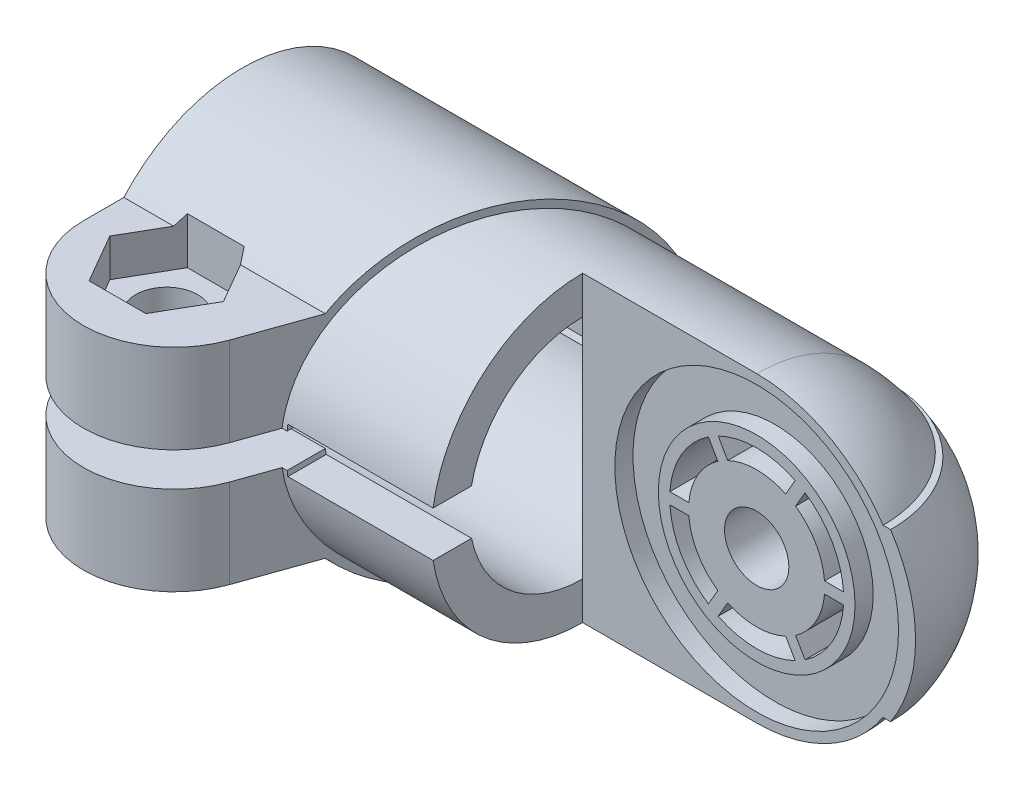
ISO-10303-21;
HEADER;
FILE_DESCRIPTION(('STEP AP214'),'2;1');
FILE_NAME('part.step','',(''),(''),'','','');
FILE_SCHEMA(('AUTOMOTIVE_DESIGN { 1 0 10303 214 1 1 1 1 }'));
ENDSEC;
DATA;
#1=APPLICATION_CONTEXT('core data for automotive mechanical design processes');
#2=APPLICATION_PROTOCOL_DEFINITION('international standard','automotive_design',2000,#1);
#3=PRODUCT_CONTEXT('',#1,'mechanical');
#4=PRODUCT('Part','Part','',(#3));
#5=PRODUCT_RELATED_PRODUCT_CATEGORY('part','',(#4));
#6=PRODUCT_DEFINITION_FORMATION('','',#4);
#7=PRODUCT_DEFINITION_CONTEXT('part definition',#1,'design');
#8=PRODUCT_DEFINITION('design','',#6,#7);
#9=PRODUCT_DEFINITION_SHAPE('','',#8);
#10=(LENGTH_UNIT() NAMED_UNIT(*) SI_UNIT(.MILLI.,.METRE.));
#11=(NAMED_UNIT(*) PLANE_ANGLE_UNIT() SI_UNIT($,.RADIAN.));
#12=(NAMED_UNIT(*) SI_UNIT($,.STERADIAN.) SOLID_ANGLE_UNIT());
#13=UNCERTAINTY_MEASURE_WITH_UNIT(LENGTH_MEASURE(1.E-05),#10,'distance_accuracy_value','');
#14=(GEOMETRIC_REPRESENTATION_CONTEXT(3) GLOBAL_UNCERTAINTY_ASSIGNED_CONTEXT((#13)) GLOBAL_UNIT_ASSIGNED_CONTEXT((#10,
#11,#12)) REPRESENTATION_CONTEXT('',''));
#15=CARTESIAN_POINT('',(0.,0.,0.));
#16=DIRECTION('',(0.,0.,1.));
#17=DIRECTION('',(1.,0.,0.));
#18=AXIS2_PLACEMENT_3D('',#15,#16,#17);
#19=CARTESIAN_POINT('',(0.,0.,0.));
#20=DIRECTION('',(1.,0.,0.));
#21=DIRECTION('',(0.,1.,0.));
#22=AXIS2_PLACEMENT_3D('',#19,#20,#21);
#23=PLANE('',#22);
#24=DIRECTION('',(0.,-1.,0.));
#25=VECTOR('',#24,1.);
#26=CARTESIAN_POINT('',(1.39645239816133E-13,-20.,0.));
#27=LINE('',#26,#25);
#28=CARTESIAN_POINT('',(-1.38777878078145E-13,20.,0.));
#29=VERTEX_POINT('',#28);
#30=CARTESIAN_POINT('',(-1.047339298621E-13,15.,0.));
#31=VERTEX_POINT('',#30);
#32=EDGE_CURVE('E26',#29,#31,#27,.T.);
#33=ORIENTED_EDGE('',*,*,#32,.F.);
#34=CARTESIAN_POINT('',(0.,0.,0.));
#35=DIRECTION('',(-1.,0.,0.));
#36=DIRECTION('',(0.,0.,1.));
#37=AXIS2_PLACEMENT_3D('',#34,#35,#36);
#38=CIRCLE('',#37,20.);
#39=CARTESIAN_POINT('',(0.,2.99999999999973,19.7737199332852));
#40=VERTEX_POINT('',#39);
#41=EDGE_CURVE('E1291',#40,#29,#38,.T.);
#42=ORIENTED_EDGE('',*,*,#41,.F.);
#43=DIRECTION('',(0.,0.,-1.));
#44=VECTOR('',#43,1.);
#45=CARTESIAN_POINT('',(0.,3.00000000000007,18.6603858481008));
#46=LINE('',#45,#44);
#47=CARTESIAN_POINT('',(0.,3.00000000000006,14.6969384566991));
#48=VERTEX_POINT('',#47);
#49=EDGE_CURVE('E880',#40,#48,#46,.T.);
#50=ORIENTED_EDGE('',*,*,#49,.T.);
#51=CARTESIAN_POINT('',(0.,0.,0.));
#52=DIRECTION('',(-1.,0.,0.));
#53=DIRECTION('',(0.,0.200000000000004,0.97979589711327));
#54=AXIS2_PLACEMENT_3D('',#51,#52,#53);
#55=CIRCLE('',#54,15.);
#56=EDGE_CURVE('E877',#48,#31,#55,.T.);
#57=ORIENTED_EDGE('',*,*,#56,.T.);
#58=EDGE_LOOP('',(#33,#42,#50,#57));
#59=FACE_BOUND('',#58,.T.);
#60=ADVANCED_FACE('F14',(#59),#23,.T.);
#61=CARTESIAN_POINT('',(1.047339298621E-13,-15.,0.));
#62=VERTEX_POINT('',#61);
#63=CARTESIAN_POINT('',(0.,-20.,0.));
#64=VERTEX_POINT('',#63);
#65=EDGE_CURVE('E9',#62,#64,#27,.T.);
#66=ORIENTED_EDGE('',*,*,#65,.F.);
#67=CARTESIAN_POINT('',(0.,0.,0.));
#68=DIRECTION('',(-1.,0.,0.));
#69=DIRECTION('',(0.,-1.,0.));
#70=AXIS2_PLACEMENT_3D('',#67,#68,#69);
#71=CIRCLE('',#70,15.);
#72=CARTESIAN_POINT('',(0.,-2.99999999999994,14.6969384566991));
#73=VERTEX_POINT('',#72);
#74=EDGE_CURVE('E890',#62,#73,#71,.T.);
#75=ORIENTED_EDGE('',*,*,#74,.T.);
#76=DIRECTION('',(0.,0.,1.));
#77=VECTOR('',#76,1.);
#78=CARTESIAN_POINT('',(0.,-2.99999999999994,14.6969384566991));
#79=LINE('',#78,#77);
#80=CARTESIAN_POINT('',(0.,-3.,19.7737199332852));
#81=VERTEX_POINT('',#80);
#82=EDGE_CURVE('E885',#81,#73,#79,.F.);
#83=ORIENTED_EDGE('',*,*,#82,.F.);
#84=EDGE_CURVE('E1296',#64,#81,#38,.T.);
#85=ORIENTED_EDGE('',*,*,#84,.F.);
#86=EDGE_LOOP('',(#66,#75,#83,#85));
#87=FACE_BOUND('',#86,.T.);
#88=ADVANCED_FACE('F1381',(#87),#23,.T.);
#89=CARTESIAN_POINT('',(-0.999999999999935,-9.,0.));
#90=DIRECTION('',(0.,-1.,0.));
#91=DIRECTION('',(1.,0.,0.));
#92=AXIS2_PLACEMENT_3D('',#89,#90,#91);
#93=PLANE('',#92);
#94=CARTESIAN_POINT('',(-34.,-9.00000000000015,21.));
#95=DIRECTION('',(0.,-1.,0.));
#96=DIRECTION('',(1.,0.,0.));
#97=AXIS2_PLACEMENT_3D('',#94,#95,#96);
#98=CIRCLE('',#97,4.1);
#99=CARTESIAN_POINT('',(-29.9,-9.00000000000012,21.));
#100=VERTEX_POINT('',#99);
#101=EDGE_CURVE('E24',#100,#100,#98,.T.);
#102=ORIENTED_EDGE('',*,*,#101,.F.);
#103=EDGE_LOOP('',(#102));
#104=FACE_BOUND('',#103,.T.);
#105=DIRECTION('',(0.499999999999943,0.,0.866025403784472));
#106=VECTOR('',#105,1.);
#107=CARTESIAN_POINT('',(-30.2472232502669,-9.00000000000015,14.5));
#108=LINE('',#107,#106);
#109=CARTESIAN_POINT('',(-30.2472232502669,-9.00000000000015,14.5));
#110=VERTEX_POINT('',#109);
#111=CARTESIAN_POINT('',(-26.494446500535,-9.0000000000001,21.));
#112=VERTEX_POINT('',#111);
#113=EDGE_CURVE('E910',#110,#112,#108,.T.);
#114=ORIENTED_EDGE('',*,*,#113,.T.);
#115=DIRECTION('',(-0.499999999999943,0.,0.866025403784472));
#116=VECTOR('',#115,1.);
#117=CARTESIAN_POINT('',(-26.494446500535,-9.0000000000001,21.));
#118=LINE('',#117,#116);
#119=CARTESIAN_POINT('',(-30.2472232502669,-9.0000000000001,27.5));
#120=VERTEX_POINT('',#119);
#121=EDGE_CURVE('E913',#112,#120,#118,.T.);
#122=ORIENTED_EDGE('',*,*,#121,.T.);
#123=DIRECTION('',(-1.,0.,0.));
#124=VECTOR('',#123,1.);
#125=CARTESIAN_POINT('',(-30.2472232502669,-9.0000000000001,27.5));
#126=LINE('',#125,#124);
#127=CARTESIAN_POINT('',(-37.7527767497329,-9.00000000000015,27.5));
#128=VERTEX_POINT('',#127);
#129=EDGE_CURVE('E916',#120,#128,#126,.T.);
#130=ORIENTED_EDGE('',*,*,#129,.T.);
#131=DIRECTION('',(-0.499999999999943,0.,-0.866025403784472));
#132=VECTOR('',#131,1.);
#133=CARTESIAN_POINT('',(-37.7527767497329,-9.00000000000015,27.5));
#134=LINE('',#133,#132);
#135=CARTESIAN_POINT('',(-41.505553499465,-9.0000000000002,21.));
#136=VERTEX_POINT('',#135);
#137=EDGE_CURVE('E919',#128,#136,#134,.T.);
#138=ORIENTED_EDGE('',*,*,#137,.T.);
#139=DIRECTION('',(0.499999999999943,0.,-0.866025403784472));
#140=VECTOR('',#139,1.);
#141=CARTESIAN_POINT('',(-41.505553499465,-9.0000000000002,21.));
#142=LINE('',#141,#140);
#143=CARTESIAN_POINT('',(-37.7527767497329,-9.0000000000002,14.5));
#144=VERTEX_POINT('',#143);
#145=EDGE_CURVE('E922',#136,#144,#142,.T.);
#146=ORIENTED_EDGE('',*,*,#145,.T.);
#147=DIRECTION('',(1.,0.,0.));
#148=VECTOR('',#147,1.);
#149=CARTESIAN_POINT('',(-37.7527767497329,-9.0000000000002,14.5));
#150=LINE('',#149,#148);
#151=EDGE_CURVE('E925',#144,#110,#150,.T.);
#152=ORIENTED_EDGE('',*,*,#151,.T.);
#153=EDGE_LOOP('',(#114,#122,#130,#138,#146,#152));
#154=FACE_BOUND('',#153,.T.);
#155=ADVANCED_FACE('F1390',(#104,#154),#93,.T.);
#156=CARTESIAN_POINT('',(-26.4944465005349,-14.,21.));
#157=DIRECTION('',(-0.866025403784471,0.,-0.499999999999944));
#158=DIRECTION('',(-0.499999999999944,0.,0.866025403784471));
#159=AXIS2_PLACEMENT_3D('',#156,#157,#158);
#160=PLANE('',#159);
#161=DIRECTION('',(0.499999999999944,0.,-0.866025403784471));
#162=VECTOR('',#161,1.);
#163=CARTESIAN_POINT('',(-30.2472232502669,-14.,27.5));
#164=LINE('',#163,#162);
#165=CARTESIAN_POINT('',(-26.4944465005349,-14.,21.));
#166=VERTEX_POINT('',#165);
#167=CARTESIAN_POINT('',(-30.2472232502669,-14.,27.5));
#168=VERTEX_POINT('',#167);
#169=EDGE_CURVE('E1234',#166,#168,#164,.F.);
#170=ORIENTED_EDGE('',*,*,#169,.T.);
#171=DIRECTION('',(0.,1.,0.));
#172=VECTOR('',#171,1.);
#173=CARTESIAN_POINT('',(-30.2472232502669,-14.,27.5));
#174=LINE('',#173,#172);
#175=EDGE_CURVE('E2321',#120,#168,#174,.F.);
#176=ORIENTED_EDGE('',*,*,#175,.F.);
#177=ORIENTED_EDGE('',*,*,#121,.F.);
#178=DIRECTION('',(0.,-1.,0.));
#179=VECTOR('',#178,1.);
#180=CARTESIAN_POINT('',(-26.494446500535,-10.,21.));
#181=LINE('',#180,#179);
#182=EDGE_CURVE('E2299',#112,#166,#181,.T.);
#183=ORIENTED_EDGE('',*,*,#182,.T.);
#184=EDGE_LOOP('',(#170,#176,#177,#183));
#185=FACE_BOUND('',#184,.T.);
#186=ADVANCED_FACE('F1398',(#185),#160,.T.);
#187=CARTESIAN_POINT('',(-30.2472232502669,-10.,27.5));
#188=DIRECTION('',(0.,0.,-1.));
#189=DIRECTION('',(0.,-1.,0.));
#190=AXIS2_PLACEMENT_3D('',#187,#188,#189);
#191=PLANE('',#190);
#192=DIRECTION('',(1.,0.,0.));
#193=VECTOR('',#192,1.);
#194=CARTESIAN_POINT('',(-37.7527767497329,-14.0000000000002,27.5));
#195=LINE('',#194,#193);
#196=CARTESIAN_POINT('',(-37.7527767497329,-14.0000000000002,27.5));
#197=VERTEX_POINT('',#196);
#198=EDGE_CURVE('E1230',#168,#197,#195,.F.);
#199=ORIENTED_EDGE('',*,*,#198,.T.);
#200=DIRECTION('',(0.,-1.,0.));
#201=VECTOR('',#200,1.);
#202=CARTESIAN_POINT('',(-37.7527767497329,-10.0000000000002,27.5));
#203=LINE('',#202,#201);
#204=EDGE_CURVE('E1295',#128,#197,#203,.T.);
#205=ORIENTED_EDGE('',*,*,#204,.F.);
#206=ORIENTED_EDGE('',*,*,#129,.F.);
#207=ORIENTED_EDGE('',*,*,#175,.T.);
#208=EDGE_LOOP('',(#199,#205,#206,#207));
#209=FACE_BOUND('',#208,.T.);
#210=ADVANCED_FACE('F1404',(#209),#191,.T.);
#211=CARTESIAN_POINT('',(-37.7527767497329,-14.0000000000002,27.5));
#212=DIRECTION('',(0.866025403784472,0.,-0.499999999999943));
#213=DIRECTION('',(-0.499999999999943,0.,-0.866025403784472));
#214=AXIS2_PLACEMENT_3D('',#211,#212,#213);
#215=PLANE('',#214);
#216=DIRECTION('',(0.499999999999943,0.,0.866025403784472));
#217=VECTOR('',#216,1.);
#218=CARTESIAN_POINT('',(-41.5055534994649,-14.0000000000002,21.));
#219=LINE('',#218,#217);
#220=CARTESIAN_POINT('',(-41.5055534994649,-14.0000000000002,21.));
#221=VERTEX_POINT('',#220);
#222=EDGE_CURVE('E1226',#197,#221,#219,.F.);
#223=ORIENTED_EDGE('',*,*,#222,.T.);
#224=DIRECTION('',(0.,-1.,0.));
#225=VECTOR('',#224,1.);
#226=CARTESIAN_POINT('',(-41.505553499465,-10.0000000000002,21.));
#227=LINE('',#226,#225);
#228=EDGE_CURVE('E1298',#136,#221,#227,.T.);
#229=ORIENTED_EDGE('',*,*,#228,.F.);
#230=ORIENTED_EDGE('',*,*,#137,.F.);
#231=ORIENTED_EDGE('',*,*,#204,.T.);
#232=EDGE_LOOP('',(#223,#229,#230,#231));
#233=FACE_BOUND('',#232,.T.);
#234=ADVANCED_FACE('F2035',(#233),#215,.T.);
#235=CARTESIAN_POINT('',(-41.5055534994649,-15.1904575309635,21.));
#236=DIRECTION('',(0.866025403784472,0.,0.499999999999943));
#237=DIRECTION('',(0.499999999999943,0.,-0.866025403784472));
#238=AXIS2_PLACEMENT_3D('',#235,#236,#237);
#239=PLANE('',#238);
#240=CARTESIAN_POINT('',(-38.4181588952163,-14.0000001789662,15.6524756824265));
#241=CARTESIAN_POINT('',(-38.2054929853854,-14.4118259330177,15.2841275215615));
#242=CARTESIAN_POINT('',(-37.9835262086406,-14.8089540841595,14.8996697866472));
#243=CARTESIAN_POINT('',(-37.7527767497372,-15.1904575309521,14.5000000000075));
#244=B_SPLINE_CURVE_WITH_KNOTS('',3,(#240,#241,#242,#243),.UNSPECIFIED.,.F.,.F.,(4,4),(0.,1.),.UNSPECIFIED.);
#245=CARTESIAN_POINT('',(-38.4181588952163,-14.0000001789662,15.6524756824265));
#246=VERTEX_POINT('',#245);
#247=CARTESIAN_POINT('',(-37.7527767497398,-15.1904575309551,14.5000000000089));
#248=VERTEX_POINT('',#247);
#249=EDGE_CURVE('E1096',#246,#248,#244,.T.);
#250=ORIENTED_EDGE('',*,*,#249,.T.);
#251=DIRECTION('',(-1.32088929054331E-12,-1.,0.));
#252=VECTOR('',#251,1.);
#253=CARTESIAN_POINT('',(-37.7527767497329,-10.0000000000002,14.5));
#254=LINE('',#253,#252);
#255=EDGE_CURVE('E2325',#144,#248,#254,.T.);
#256=ORIENTED_EDGE('',*,*,#255,.F.);
#257=ORIENTED_EDGE('',*,*,#145,.F.);
#258=ORIENTED_EDGE('',*,*,#228,.T.);
#259=DIRECTION('',(-0.499999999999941,0.,0.866025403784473));
#260=VECTOR('',#259,1.);
#261=CARTESIAN_POINT('',(-38.4181588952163,-14.0000000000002,15.6524756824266));
#262=LINE('',#261,#260);
#263=EDGE_CURVE('E1222',#221,#246,#262,.F.);
#264=ORIENTED_EDGE('',*,*,#263,.T.);
#265=EDGE_LOOP('',(#250,#256,#257,#258,#264));
#266=FACE_BOUND('',#265,.T.);
#267=ADVANCED_FACE('F2044',(#266),#239,.T.);
#268=CARTESIAN_POINT('',(-30.2472232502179,-15.190457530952,14.5));
#269=DIRECTION('',(0.,0.,1.));
#270=DIRECTION('',(0.,1.,0.));
#271=AXIS2_PLACEMENT_3D('',#268,#269,#270);
#272=PLANE('',#271);
#273=DIRECTION('',(-1.,-9.67670437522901E-12,-1.01302857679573E-11));
#274=VECTOR('',#273,1.);
#275=CARTESIAN_POINT('',(-30.2472232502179,-15.1904575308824,14.5000000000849));
#276=LINE('',#275,#274);
#277=CARTESIAN_POINT('',(-30.2472232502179,-15.1904575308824,14.5000000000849));
#278=VERTEX_POINT('',#277);
#279=EDGE_CURVE('E1065',#248,#278,#276,.F.);
#280=ORIENTED_EDGE('',*,*,#279,.T.);
#281=DIRECTION('',(-9.44582748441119E-12,1.,0.));
#282=VECTOR('',#281,1.);
#283=CARTESIAN_POINT('',(-30.2472232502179,-15.1904575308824,14.5));
#284=LINE('',#283,#282);
#285=EDGE_CURVE('E2329',#110,#278,#284,.F.);
#286=ORIENTED_EDGE('',*,*,#285,.F.);
#287=ORIENTED_EDGE('',*,*,#151,.F.);
#288=ORIENTED_EDGE('',*,*,#255,.T.);
#289=EDGE_LOOP('',(#280,#286,#287,#288));
#290=FACE_BOUND('',#289,.T.);
#291=ADVANCED_FACE('F2052',(#290),#272,.T.);
#292=CARTESIAN_POINT('',(-30.2472232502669,-15.1904575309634,14.5));
#293=DIRECTION('',(-0.866025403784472,0.,0.499999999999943));
#294=DIRECTION('',(0.499999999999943,0.,0.866025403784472));
#295=AXIS2_PLACEMENT_3D('',#292,#293,#294);
#296=PLANE('',#295);
#297=CARTESIAN_POINT('',(-30.2472232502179,-15.1904575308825,14.5000000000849));
#298=CARTESIAN_POINT('',(-30.0164737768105,-14.8089540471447,14.8996698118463));
#299=CARTESIAN_POINT('',(-29.794506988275,-14.4118258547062,15.2841275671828));
#300=CARTESIAN_POINT('',(-29.581841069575,-14.0000000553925,15.6524757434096));
#301=B_SPLINE_CURVE_WITH_KNOTS('',3,(#297,#298,#299,#300),.UNSPECIFIED.,.F.,.F.,(4,4),(0.,1.),.UNSPECIFIED.);
#302=CARTESIAN_POINT('',(-29.581841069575,-14.0000000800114,15.6524757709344));
#303=VERTEX_POINT('',#302);
#304=EDGE_CURVE('E1076',#278,#303,#301,.T.);
#305=ORIENTED_EDGE('',*,*,#304,.T.);
#306=DIRECTION('',(-0.499999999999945,0.,-0.866025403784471));
#307=VECTOR('',#306,1.);
#308=CARTESIAN_POINT('',(-26.4944465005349,-14.,21.));
#309=LINE('',#308,#307);
#310=EDGE_CURVE('E1206',#303,#166,#309,.F.);
#311=ORIENTED_EDGE('',*,*,#310,.T.);
#312=ORIENTED_EDGE('',*,*,#182,.F.);
#313=ORIENTED_EDGE('',*,*,#113,.F.);
#314=ORIENTED_EDGE('',*,*,#285,.T.);
#315=EDGE_LOOP('',(#305,#311,#312,#313,#314));
#316=FACE_BOUND('',#315,.T.);
#317=ADVANCED_FACE('F1372',(#316),#296,.T.);
#318=CARTESIAN_POINT('',(-30.2472232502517,9.99999999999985,14.5));
#319=DIRECTION('',(0.,0.,1.));
#320=DIRECTION('',(0.,1.,0.));
#321=AXIS2_PLACEMENT_3D('',#318,#319,#320);
#322=PLANE('',#321);
#323=DIRECTION('',(1.,-1.53807419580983E-11,1.61202257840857E-11));
#324=VECTOR('',#323,1.);
#325=CARTESIAN_POINT('',(-37.7527767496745,15.1904575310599,14.4999999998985));
#326=LINE('',#325,#324);
#327=CARTESIAN_POINT('',(-30.2472232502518,15.1904575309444,14.5000000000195));
#328=VERTEX_POINT('',#327);
#329=CARTESIAN_POINT('',(-37.7527767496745,15.1904575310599,14.4999999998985));
#330=VERTEX_POINT('',#329);
#331=EDGE_CURVE('E1123',#328,#330,#326,.F.);
#332=ORIENTED_EDGE('',*,*,#331,.T.);
#333=DIRECTION('',(-1.1270348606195E-11,-1.,0.));
#334=VECTOR('',#333,1.);
#335=CARTESIAN_POINT('',(-37.7527767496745,15.1904575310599,14.5));
#336=LINE('',#335,#334);
#337=CARTESIAN_POINT('',(-37.7527767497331,9.99999999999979,14.5));
#338=VERTEX_POINT('',#337);
#339=EDGE_CURVE('E1134',#330,#338,#336,.T.);
#340=ORIENTED_EDGE('',*,*,#339,.T.);
#341=DIRECTION('',(0.,1.,0.));
#342=VECTOR('',#341,1.);
#343=CARTESIAN_POINT('',(-37.7527767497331,8.99999999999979,14.5));
#344=LINE('',#343,#342);
#345=CARTESIAN_POINT('',(-37.7527767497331,8.99999999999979,14.5));
#346=VERTEX_POINT('',#345);
#347=EDGE_CURVE('E949',#346,#338,#344,.T.);
#348=ORIENTED_EDGE('',*,*,#347,.F.);
#349=DIRECTION('',(-1.,0.,0.));
#350=VECTOR('',#349,1.);
#351=CARTESIAN_POINT('',(-30.2472232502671,8.99999999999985,14.5));
#352=LINE('',#351,#350);
#353=CARTESIAN_POINT('',(-30.2472232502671,8.99999999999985,14.5));
#354=VERTEX_POINT('',#353);
#355=EDGE_CURVE('E940',#354,#346,#352,.T.);
#356=ORIENTED_EDGE('',*,*,#355,.F.);
#357=DIRECTION('',(2.94582162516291E-12,1.,0.));
#358=VECTOR('',#357,1.);
#359=CARTESIAN_POINT('',(-30.2472232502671,9.99999999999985,14.5));
#360=LINE('',#359,#358);
#361=EDGE_CURVE('E1136',#328,#354,#360,.F.);
#362=ORIENTED_EDGE('',*,*,#361,.F.);
#363=EDGE_LOOP('',(#332,#340,#348,#356,#362));
#364=FACE_BOUND('',#363,.T.);
#365=ADVANCED_FACE('F1133',(#364),#322,.T.);
#366=CARTESIAN_POINT('',(-41.505553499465,9.99999999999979,21.));
#367=DIRECTION('',(0.866025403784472,0.,0.499999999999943));
#368=DIRECTION('',(0.499999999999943,0.,-0.866025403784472));
#369=AXIS2_PLACEMENT_3D('',#366,#367,#368);
#370=PLANE('',#369);
#371=CARTESIAN_POINT('',(-37.7527767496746,15.1904575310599,14.4999999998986));
#372=CARTESIAN_POINT('',(-37.983526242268,14.8089540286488,14.8996698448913));
#373=CARTESIAN_POINT('',(-38.2054930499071,14.4118258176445,15.2841276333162));
#374=CARTESIAN_POINT('',(-38.4181589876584,13.9999999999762,15.6524758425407));
#375=B_SPLINE_CURVE_WITH_KNOTS('',3,(#371,#372,#373,#374),.UNSPECIFIED.,.F.,.F.,(4,4),(0.,1.),.UNSPECIFIED.);
#376=CARTESIAN_POINT('',(-38.4181589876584,13.9999999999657,15.6524758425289));
#377=VERTEX_POINT('',#376);
#378=EDGE_CURVE('E1117',#330,#377,#375,.T.);
#379=ORIENTED_EDGE('',*,*,#378,.T.);
#380=DIRECTION('',(0.499999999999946,0.,-0.86602540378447));
#381=VECTOR('',#380,1.);
#382=CARTESIAN_POINT('',(-41.5055534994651,13.9999999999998,21.));
#383=LINE('',#382,#381);
#384=CARTESIAN_POINT('',(-41.5055534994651,13.9999999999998,21.));
#385=VERTEX_POINT('',#384);
#386=EDGE_CURVE('E1256',#385,#377,#383,.T.);
#387=ORIENTED_EDGE('',*,*,#386,.F.);
#388=DIRECTION('',(0.,-1.,0.));
#389=VECTOR('',#388,1.);
#390=CARTESIAN_POINT('',(-41.5055534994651,13.9999999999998,21.));
#391=LINE('',#390,#389);
#392=CARTESIAN_POINT('',(-41.505553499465,8.99999999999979,21.));
#393=VERTEX_POINT('',#392);
#394=EDGE_CURVE('E2341',#385,#393,#391,.T.);
#395=ORIENTED_EDGE('',*,*,#394,.T.);
#396=DIRECTION('',(-0.499999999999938,0.,0.866025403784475));
#397=VECTOR('',#396,1.);
#398=CARTESIAN_POINT('',(-37.7527767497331,8.99999999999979,14.5));
#399=LINE('',#398,#397);
#400=EDGE_CURVE('E943',#346,#393,#399,.T.);
#401=ORIENTED_EDGE('',*,*,#400,.F.);
#402=ORIENTED_EDGE('',*,*,#347,.T.);
#403=ORIENTED_EDGE('',*,*,#339,.F.);
#404=EDGE_LOOP('',(#379,#387,#395,#401,#402,#403));
#405=FACE_BOUND('',#404,.T.);
#406=ADVANCED_FACE('F1367',(#405),#370,.T.);
#407=CARTESIAN_POINT('',(-37.7527767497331,9.99999999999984,27.5));
#408=DIRECTION('',(0.866025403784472,0.,-0.499999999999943));
#409=DIRECTION('',(-0.499999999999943,0.,-0.866025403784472));
#410=AXIS2_PLACEMENT_3D('',#407,#408,#409);
#411=PLANE('',#410);
#412=DIRECTION('',(0.,-1.,0.));
#413=VECTOR('',#412,1.);
#414=CARTESIAN_POINT('',(-37.7527767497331,13.9999999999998,27.5));
#415=LINE('',#414,#413);
#416=CARTESIAN_POINT('',(-37.7527767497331,13.9999999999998,27.5));
#417=VERTEX_POINT('',#416);
#418=CARTESIAN_POINT('',(-37.7527767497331,8.99999999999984,27.5));
#419=VERTEX_POINT('',#418);
#420=EDGE_CURVE('E2333',#417,#419,#415,.T.);
#421=ORIENTED_EDGE('',*,*,#420,.T.);
#422=DIRECTION('',(0.499999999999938,0.,0.866025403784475));
#423=VECTOR('',#422,1.);
#424=CARTESIAN_POINT('',(-41.505553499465,8.99999999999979,21.));
#425=LINE('',#424,#423);
#426=EDGE_CURVE('E946',#393,#419,#425,.T.);
#427=ORIENTED_EDGE('',*,*,#426,.F.);
#428=ORIENTED_EDGE('',*,*,#394,.F.);
#429=DIRECTION('',(-0.499999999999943,0.,-0.866025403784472));
#430=VECTOR('',#429,1.);
#431=CARTESIAN_POINT('',(-37.7527767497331,13.9999999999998,27.5));
#432=LINE('',#431,#430);
#433=EDGE_CURVE('E1251',#417,#385,#432,.T.);
#434=ORIENTED_EDGE('',*,*,#433,.F.);
#435=EDGE_LOOP('',(#421,#427,#428,#434));
#436=FACE_BOUND('',#435,.T.);
#437=ADVANCED_FACE('F2056',(#436),#411,.T.);
#438=CARTESIAN_POINT('',(-30.2472232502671,14.,27.5));
#439=DIRECTION('',(0.,0.,-1.));
#440=DIRECTION('',(0.,-1.,0.));
#441=AXIS2_PLACEMENT_3D('',#438,#439,#440);
#442=PLANE('',#441);
#443=DIRECTION('',(0.,1.,0.));
#444=VECTOR('',#443,1.);
#445=CARTESIAN_POINT('',(-30.2472232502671,9.99999999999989,27.5));
#446=LINE('',#445,#444);
#447=CARTESIAN_POINT('',(-30.2472232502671,14.,27.5));
#448=VERTEX_POINT('',#447);
#449=CARTESIAN_POINT('',(-30.2472232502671,8.99999999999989,27.5));
#450=VERTEX_POINT('',#449);
#451=EDGE_CURVE('E2337',#448,#450,#446,.F.);
#452=ORIENTED_EDGE('',*,*,#451,.T.);
#453=DIRECTION('',(1.,0.,0.));
#454=VECTOR('',#453,1.);
#455=CARTESIAN_POINT('',(-37.7527767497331,8.99999999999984,27.5));
#456=LINE('',#455,#454);
#457=EDGE_CURVE('E931',#419,#450,#456,.T.);
#458=ORIENTED_EDGE('',*,*,#457,.F.);
#459=ORIENTED_EDGE('',*,*,#420,.F.);
#460=DIRECTION('',(-1.,0.,0.));
#461=VECTOR('',#460,1.);
#462=CARTESIAN_POINT('',(-30.2472232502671,14.,27.5));
#463=LINE('',#462,#461);
#464=EDGE_CURVE('E1246',#448,#417,#463,.T.);
#465=ORIENTED_EDGE('',*,*,#464,.F.);
#466=EDGE_LOOP('',(#452,#458,#459,#465));
#467=FACE_BOUND('',#466,.T.);
#468=ADVANCED_FACE('F2061',(#467),#442,.T.);
#469=CARTESIAN_POINT('',(-26.4944465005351,10.,21.));
#470=DIRECTION('',(-0.866025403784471,0.,-0.499999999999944));
#471=DIRECTION('',(-0.499999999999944,0.,0.866025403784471));
#472=AXIS2_PLACEMENT_3D('',#469,#470,#471);
#473=PLANE('',#472);
#474=DIRECTION('',(0.,1.,0.));
#475=VECTOR('',#474,1.);
#476=CARTESIAN_POINT('',(-26.4944465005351,10.,21.));
#477=LINE('',#476,#475);
#478=CARTESIAN_POINT('',(-26.4944465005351,14.,21.));
#479=VERTEX_POINT('',#478);
#480=CARTESIAN_POINT('',(-26.4944465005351,8.99999999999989,21.));
#481=VERTEX_POINT('',#480);
#482=EDGE_CURVE('E1347',#479,#481,#477,.F.);
#483=ORIENTED_EDGE('',*,*,#482,.T.);
#484=DIRECTION('',(0.499999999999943,0.,-0.866025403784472));
#485=VECTOR('',#484,1.);
#486=CARTESIAN_POINT('',(-30.2472232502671,8.99999999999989,27.5));
#487=LINE('',#486,#485);
#488=EDGE_CURVE('E934',#450,#481,#487,.T.);
#489=ORIENTED_EDGE('',*,*,#488,.F.);
#490=ORIENTED_EDGE('',*,*,#451,.F.);
#491=DIRECTION('',(-0.499999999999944,0.,0.866025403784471));
#492=VECTOR('',#491,1.);
#493=CARTESIAN_POINT('',(-26.4944465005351,14.,21.));
#494=LINE('',#493,#492);
#495=EDGE_CURVE('E1242',#479,#448,#494,.T.);
#496=ORIENTED_EDGE('',*,*,#495,.F.);
#497=EDGE_LOOP('',(#483,#489,#490,#496));
#498=FACE_BOUND('',#497,.T.);
#499=ADVANCED_FACE('F1366',(#498),#473,.T.);
#500=CARTESIAN_POINT('',(-30.2472232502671,9.99999999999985,14.5));
#501=DIRECTION('',(-0.866025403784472,0.,0.499999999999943));
#502=DIRECTION('',(0.499999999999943,0.,0.866025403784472));
#503=AXIS2_PLACEMENT_3D('',#500,#501,#502);
#504=PLANE('',#503);
#505=CARTESIAN_POINT('',(-29.581841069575,14.0000001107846,15.6524757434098));
#506=CARTESIAN_POINT('',(-29.794506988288,14.4118258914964,15.2841275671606));
#507=CARTESIAN_POINT('',(-30.0164737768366,14.8089540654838,14.8996698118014));
#508=CARTESIAN_POINT('',(-30.2472232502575,15.1904575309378,14.5000000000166));
#509=B_SPLINE_CURVE_WITH_KNOTS('',3,(#505,#506,#507,#508),.UNSPECIFIED.,.F.,.F.,(4,4),(0.,1.),.UNSPECIFIED.);
#510=CARTESIAN_POINT('',(-29.5818410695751,14.0000001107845,15.6524757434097));
#511=VERTEX_POINT('',#510);
#512=EDGE_CURVE('E1137',#511,#328,#509,.T.);
#513=ORIENTED_EDGE('',*,*,#512,.T.);
#514=ORIENTED_EDGE('',*,*,#361,.T.);
#515=DIRECTION('',(-0.499999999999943,0.,-0.866025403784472));
#516=VECTOR('',#515,1.);
#517=CARTESIAN_POINT('',(-26.4944465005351,8.99999999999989,21.));
#518=LINE('',#517,#516);
#519=EDGE_CURVE('E937',#481,#354,#518,.T.);
#520=ORIENTED_EDGE('',*,*,#519,.F.);
#521=ORIENTED_EDGE('',*,*,#482,.F.);
#522=DIRECTION('',(0.499999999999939,0.,0.866025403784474));
#523=VECTOR('',#522,1.);
#524=CARTESIAN_POINT('',(-29.5818410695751,13.9999999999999,15.6524757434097));
#525=LINE('',#524,#523);
#526=EDGE_CURVE('E1150',#511,#479,#525,.T.);
#527=ORIENTED_EDGE('',*,*,#526,.F.);
#528=EDGE_LOOP('',(#513,#514,#520,#521,#527));
#529=FACE_BOUND('',#528,.T.);
#530=ADVANCED_FACE('F1355',(#529),#504,.T.);
#531=CARTESIAN_POINT('',(-1.00000000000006,9.,0.));
#532=DIRECTION('',(0.,1.,0.));
#533=DIRECTION('',(-1.,0.,0.));
#534=AXIS2_PLACEMENT_3D('',#531,#532,#533);
#535=PLANE('',#534);
#536=CARTESIAN_POINT('',(-34.,8.99999999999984,21.));
#537=DIRECTION('',(0.,1.,0.));
#538=DIRECTION('',(-1.,0.,0.));
#539=AXIS2_PLACEMENT_3D('',#536,#537,#538);
#540=CIRCLE('',#539,4.1);
#541=CARTESIAN_POINT('',(-38.1,8.99999999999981,21.));
#542=VERTEX_POINT('',#541);
#543=EDGE_CURVE('E928',#542,#542,#540,.T.);
#544=ORIENTED_EDGE('',*,*,#543,.F.);
#545=EDGE_LOOP('',(#544));
#546=FACE_BOUND('',#545,.T.);
#547=ORIENTED_EDGE('',*,*,#457,.T.);
#548=ORIENTED_EDGE('',*,*,#488,.T.);
#549=ORIENTED_EDGE('',*,*,#519,.T.);
#550=ORIENTED_EDGE('',*,*,#355,.T.);
#551=ORIENTED_EDGE('',*,*,#400,.T.);
#552=ORIENTED_EDGE('',*,*,#426,.T.);
#553=EDGE_LOOP('',(#547,#548,#549,#550,#551,#552));
#554=FACE_BOUND('',#553,.T.);
#555=ADVANCED_FACE('F1365',(#546,#554),#535,.T.);
#556=CARTESIAN_POINT('',(-34.0000000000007,100.,20.9999999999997));
#557=DIRECTION('',(0.,-1.,0.));
#558=DIRECTION('',(-1.,0.,0.));
#559=AXIS2_PLACEMENT_3D('',#556,#557,#558);
#560=CYLINDRICAL_SURFACE('',#559,4.1);
#561=CARTESIAN_POINT('',(-34.,-2.25000000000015,21.));
#562=DIRECTION('',(0.,-1.,0.));
#563=DIRECTION('',(-1.,0.,0.));
#564=AXIS2_PLACEMENT_3D('',#561,#562,#563);
#565=CIRCLE('',#564,4.1);
#566=CARTESIAN_POINT('',(-38.1,-2.25000000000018,21.));
#567=VERTEX_POINT('',#566);
#568=EDGE_CURVE('E2272',#567,#567,#565,.T.);
#569=ORIENTED_EDGE('',*,*,#568,.F.);
#570=EDGE_LOOP('',(#569));
#571=FACE_BOUND('',#570,.T.);
#572=ORIENTED_EDGE('',*,*,#101,.T.);
#573=EDGE_LOOP('',(#572));
#574=FACE_BOUND('',#573,.T.);
#575=ADVANCED_FACE('F1412',(#571,#574),#560,.F.);
#576=CARTESIAN_POINT('',(-33.,13.9999999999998,21.));
#577=DIRECTION('',(0.,-1.,0.));
#578=DIRECTION('',(0.942661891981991,0.,0.333749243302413));
#579=AXIS2_PLACEMENT_3D('',#576,#577,#578);
#580=CYLINDRICAL_SURFACE('',#579,12.);
#581=CARTESIAN_POINT('',(-33.,-2.25000000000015,21.));
#582=DIRECTION('',(0.,1.,0.));
#583=DIRECTION('',(-1.,0.,0.));
#584=AXIS2_PLACEMENT_3D('',#581,#582,#583);
#585=CIRCLE('',#584,12.);
#586=CARTESIAN_POINT('',(-45.,-2.25000000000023,21.));
#587=VERTEX_POINT('',#586);
#588=CARTESIAN_POINT('',(-21.6880572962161,-2.25000000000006,25.004990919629));
#589=VERTEX_POINT('',#588);
#590=EDGE_CURVE('E2260',#587,#589,#585,.T.);
#591=ORIENTED_EDGE('',*,*,#590,.F.);
#592=DIRECTION('',(0.,1.,0.));
#593=VECTOR('',#592,1.);
#594=CARTESIAN_POINT('',(-45.,-14.0000000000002,21.));
#595=LINE('',#594,#593);
#596=CARTESIAN_POINT('',(-45.,-14.0000000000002,21.));
#597=VERTEX_POINT('',#596);
#598=EDGE_CURVE('E2275',#587,#597,#595,.F.);
#599=ORIENTED_EDGE('',*,*,#598,.T.);
#600=CARTESIAN_POINT('',(-33.,-14.0000000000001,21.));
#601=DIRECTION('',(0.,-1.,0.));
#602=DIRECTION('',(0.942661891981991,0.,0.333749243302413));
#603=AXIS2_PLACEMENT_3D('',#600,#601,#602);
#604=CIRCLE('',#603,12.);
#605=CARTESIAN_POINT('',(-21.6880572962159,-14.,25.004990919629));
#606=VERTEX_POINT('',#605);
#607=EDGE_CURVE('E1209',#597,#606,#604,.F.);
#608=ORIENTED_EDGE('',*,*,#607,.T.);
#609=DIRECTION('',(0.,-1.,0.));
#610=VECTOR('',#609,1.);
#611=CARTESIAN_POINT('',(-21.6880572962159,-2.25000000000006,25.004990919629));
#612=LINE('',#611,#610);
#613=EDGE_CURVE('E1334',#589,#606,#612,.T.);
#614=ORIENTED_EDGE('',*,*,#613,.F.);
#615=EDGE_LOOP('',(#591,#599,#608,#614));
#616=FACE_BOUND('',#615,.T.);
#617=ADVANCED_FACE('F2127',(#616),#580,.T.);
#618=CARTESIAN_POINT('',(-18.3768012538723,-14.,15.6524756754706));
#619=DIRECTION('',(0.,-1.,0.));
#620=DIRECTION('',(0.,0.,1.));
#621=AXIS2_PLACEMENT_3D('',#618,#619,#620);
#622=PLANE('',#621);
#623=ORIENTED_EDGE('',*,*,#310,.F.);
#624=DIRECTION('',(-1.,9.52532434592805E-09,8.51971527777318E-09));
#625=VECTOR('',#624,1.);
#626=CARTESIAN_POINT('',(-18.3768012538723,-14.000000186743,15.6524756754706));
#627=LINE('',#626,#625);
#628=CARTESIAN_POINT('',(-18.3768012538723,-14.000000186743,15.6524756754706));
#629=VERTEX_POINT('',#628);
#630=EDGE_CURVE('E1080',#303,#629,#627,.F.);
#631=ORIENTED_EDGE('',*,*,#630,.T.);
#632=DIRECTION('',(-0.333749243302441,0.,0.942661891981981));
#633=VECTOR('',#632,1.);
#634=CARTESIAN_POINT('',(-18.3768012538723,-14.,15.6524756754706));
#635=LINE('',#634,#633);
#636=EDGE_CURVE('E1207',#606,#629,#635,.F.);
#637=ORIENTED_EDGE('',*,*,#636,.F.);
#638=ORIENTED_EDGE('',*,*,#607,.F.);
#639=DIRECTION('',(0.,0.,-1.));
#640=VECTOR('',#639,1.);
#641=CARTESIAN_POINT('',(-45.,-14.0000000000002,21.));
#642=LINE('',#641,#640);
#643=CARTESIAN_POINT('',(-45.,-14.0000000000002,15.6524758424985));
#644=VERTEX_POINT('',#643);
#645=EDGE_CURVE('E1217',#644,#597,#642,.F.);
#646=ORIENTED_EDGE('',*,*,#645,.F.);
#647=DIRECTION('',(-1.,2.71908610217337E-08,2.43202516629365E-08));
#648=VECTOR('',#647,1.);
#649=CARTESIAN_POINT('',(-38.4181588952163,-14.0000001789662,15.6524756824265));
#650=LINE('',#649,#648);
#651=EDGE_CURVE('E1099',#644,#246,#650,.F.);
#652=ORIENTED_EDGE('',*,*,#651,.T.);
#653=ORIENTED_EDGE('',*,*,#263,.F.);
#654=ORIENTED_EDGE('',*,*,#222,.F.);
#655=ORIENTED_EDGE('',*,*,#198,.F.);
#656=ORIENTED_EDGE('',*,*,#169,.F.);
#657=EDGE_LOOP('',(#623,#631,#637,#638,#646,#652,#653,#654,#655,#656));
#658=FACE_BOUND('',#657,.T.);
#659=ADVANCED_FACE('F1025',(#658),#622,.T.);
#660=CARTESIAN_POINT('',(-45.,-3.07250357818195E-13,0.));
#661=DIRECTION('',(-1.,0.,0.));
#662=DIRECTION('',(0.,3.12283532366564E-12,-1.));
#663=AXIS2_PLACEMENT_3D('',#660,#661,#662);
#664=CYLINDRICAL_SURFACE('',#663,21.);
#665=ORIENTED_EDGE('',*,*,#651,.F.);
#666=CARTESIAN_POINT('',(-45.,-3.07250357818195E-13,0.));
#667=DIRECTION('',(1.,0.,0.));
#668=DIRECTION('',(0.,-0.666666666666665,0.745355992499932));
#669=AXIS2_PLACEMENT_3D('',#666,#667,#668);
#670=CIRCLE('',#669,21.);
#671=CARTESIAN_POINT('',(-45.,13.9999999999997,15.6524758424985));
#672=VERTEX_POINT('',#671);
#673=EDGE_CURVE('E1104',#672,#644,#670,.F.);
#674=ORIENTED_EDGE('',*,*,#673,.F.);
#675=DIRECTION('',(1.,-5.16838038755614E-12,4.62911098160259E-12));
#676=VECTOR('',#675,1.);
#677=CARTESIAN_POINT('',(-45.,13.9999999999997,15.6524758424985));
#678=LINE('',#677,#676);
#679=EDGE_CURVE('E1108',#672,#377,#678,.T.);
#680=ORIENTED_EDGE('',*,*,#679,.T.);
#681=ORIENTED_EDGE('',*,*,#378,.F.);
#682=ORIENTED_EDGE('',*,*,#331,.F.);
#683=ORIENTED_EDGE('',*,*,#512,.F.);
#684=DIRECTION('',(1.,-9.62312259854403E-09,8.60718865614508E-09));
#685=VECTOR('',#684,1.);
#686=CARTESIAN_POINT('',(-29.5818410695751,14.0000001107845,15.6524757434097));
#687=LINE('',#686,#685);
#688=CARTESIAN_POINT('',(-18.3768013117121,14.000000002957,15.6524758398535));
#689=VERTEX_POINT('',#688);
#690=EDGE_CURVE('E1138',#511,#689,#687,.T.);
#691=ORIENTED_EDGE('',*,*,#690,.T.);
#692=CARTESIAN_POINT('',(-5.96064221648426,8.00000048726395,-19.4164876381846));
#693=CARTESIAN_POINT('',(-6.30627257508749,10.3693449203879,-18.4402679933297));
#694=CARTESIAN_POINT('',(-6.80252068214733,12.5400055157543,-17.0386343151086));
#695=CARTESIAN_POINT('',(-7.98592250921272,16.0857868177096,-13.6961614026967));
#696=CARTESIAN_POINT('',(-8.64198947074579,17.4955904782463,-11.8431255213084));
#697=CARTESIAN_POINT('',(-10.1077021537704,19.679461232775,-7.70327646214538));
#698=CARTESIAN_POINT('',(-10.91111217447,20.4262796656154,-5.434075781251));
#699=CARTESIAN_POINT('',(-12.4348270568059,21.0603345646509,-1.13040174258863));
#700=CARTESIAN_POINT('',(-13.1247575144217,21.073127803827,0.818280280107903));
#701=CARTESIAN_POINT('',(-14.4807890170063,20.5700766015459,4.64833906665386));
#702=CARTESIAN_POINT('',(-15.1468900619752,20.0542321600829,6.52971583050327));
#703=CARTESIAN_POINT('',(-16.466235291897,18.4458794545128,10.2561556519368));
#704=CARTESIAN_POINT('',(-17.1035104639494,17.3241699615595,12.0561148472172));
#705=CARTESIAN_POINT('',(-17.9208254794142,15.3469544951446,14.3645896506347));
#706=CARTESIAN_POINT('',(-18.1567529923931,14.694878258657,15.0309578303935));
#707=CARTESIAN_POINT('',(-18.3768013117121,14.0000000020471,15.6524758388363));
#708=B_SPLINE_CURVE_WITH_KNOTS('',3,(#692,#693,#694,#695,#696,#697,#698,#699,#700,#701,#702,
#703,#704,#705,#706,#707),.UNSPECIFIED.,.F.,.F.,(4,2,2,2,2,2,2,4),(0.,0.182064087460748,
0.346202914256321,0.514740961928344,0.651339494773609,0.787938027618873,0.93539626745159,1.),.UNSPECIFIED.);
#709=CARTESIAN_POINT('',(-5.96064214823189,8.00000001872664,-19.4164878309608));
#710=VERTEX_POINT('',#709);
#711=EDGE_CURVE('E1154',#710,#689,#708,.T.);
#712=ORIENTED_EDGE('',*,*,#711,.F.);
#713=CARTESIAN_POINT('',(-12.8350455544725,0.,0.));
#714=DIRECTION('',(0.942661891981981,0.,0.333749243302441));
#715=DIRECTION('',(-0.333749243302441,0.,0.942661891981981));
#716=AXIS2_PLACEMENT_3D('',#713,#714,#715);
#717=ELLIPSE('',#716,22.2773405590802,20.9999999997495);
#718=CARTESIAN_POINT('',(-5.75404978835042,6.40312423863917,-19.9999999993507));
#719=VERTEX_POINT('',#718);
#720=EDGE_CURVE('E992',#719,#710,#717,.T.);
#721=ORIENTED_EDGE('',*,*,#720,.F.);
#722=CARTESIAN_POINT('',(-5.39999993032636,4.21598519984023E-11,-21.0000001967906));
#723=CARTESIAN_POINT('',(-5.39999948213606,0.235321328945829,-21.0000014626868));
#724=CARTESIAN_POINT('',(-5.40139425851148,0.470700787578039,-20.9960619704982));
#725=CARTESIAN_POINT('',(-5.40761661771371,0.994674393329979,-20.9784871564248));
#726=CARTESIAN_POINT('',(-5.41315343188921,1.28296759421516,-20.9628486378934));
#727=CARTESIAN_POINT('',(-5.42832038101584,1.85415603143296,-20.9200101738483));
#728=CARTESIAN_POINT('',(-5.43788723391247,2.13706687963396,-20.8929889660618));
#729=CARTESIAN_POINT('',(-5.46925883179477,2.90044904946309,-20.8043810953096));
#730=CARTESIAN_POINT('',(-5.49393918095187,3.35868244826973,-20.7346723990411));
#731=CARTESIAN_POINT('',(-5.56433800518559,4.43787085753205,-20.5358336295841));
#732=CARTESIAN_POINT('',(-5.61372400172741,5.03587941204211,-20.3963447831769));
#733=CARTESIAN_POINT('',(-5.69693187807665,5.88187407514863,-20.1613273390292));
#734=CARTESIAN_POINT('',(-5.7245849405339,6.14318059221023,-20.0832223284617));
#735=CARTESIAN_POINT('',(-5.75404978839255,6.40312423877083,-19.999999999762));
#736=B_SPLINE_CURVE_WITH_KNOTS('',3,(#722,#723,#724,#725,#726,#727,#728,#729,#730,#731,#732,
#733,#734,#735),.UNSPECIFIED.,.F.,.F.,(4,2,2,2,2,2,4),(0.,0.103072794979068,0.229661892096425,
0.3543332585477,0.566663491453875,0.865452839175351,1.),.UNSPECIFIED.);
#737=CARTESIAN_POINT('',(-5.39999937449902,4.21587706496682E-11,-21.));
#738=VERTEX_POINT('',#737);
#739=EDGE_CURVE('E1155',#738,#719,#736,.T.);
#740=ORIENTED_EDGE('',*,*,#739,.F.);
#741=CARTESIAN_POINT('',(-5.75405018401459,-6.40312772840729,-19.9999988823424));
#742=CARTESIAN_POINT('',(-5.69550772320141,-5.88665668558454,-20.1653498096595));
#743=CARTESIAN_POINT('',(-5.64407020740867,-5.3639745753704,-20.3106330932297));
#744=CARTESIAN_POINT('',(-5.55660247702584,-4.32006875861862,-20.5576823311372));
#745=CARTESIAN_POINT('',(-5.51959890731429,-3.79292233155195,-20.6621974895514));
#746=CARTESIAN_POINT('',(-5.47180208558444,-2.92849746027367,-20.7971977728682));
#747=CARTESIAN_POINT('',(-5.45705833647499,-2.61600280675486,-20.8388409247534));
#748=CARTESIAN_POINT('',(-5.43093792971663,-1.94778737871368,-20.9126170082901));
#749=CARTESIAN_POINT('',(-5.42010246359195,-1.58844565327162,-20.9432213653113));
#750=CARTESIAN_POINT('',(-5.40416993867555,-0.813335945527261,-20.9882221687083));
#751=CARTESIAN_POINT('',(-5.40000065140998,-0.406754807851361,-20.9999981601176));
#752=CARTESIAN_POINT('',(-5.39999993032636,4.21598519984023E-11,-21.0000001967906));
#753=B_SPLINE_CURVE_WITH_KNOTS('',3,(#741,#742,#743,#744,#745,#746,#747,#748,#749,#750,#751,
#752),.UNSPECIFIED.,.F.,.F.,(4,2,2,2,2,4),(0.,0.260315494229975,0.514943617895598,
0.658664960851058,0.821660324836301,1.),.UNSPECIFIED.);
#754=CARTESIAN_POINT('',(-5.75405015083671,-6.40312743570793,-19.9999989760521));
#755=VERTEX_POINT('',#754);
#756=EDGE_CURVE('E1003',#755,#738,#753,.T.);
#757=ORIENTED_EDGE('',*,*,#756,.F.);
#758=CARTESIAN_POINT('',(-12.8350455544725,0.,0.));
#759=DIRECTION('',(0.942661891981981,0.,0.333749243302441));
#760=DIRECTION('',(-0.333749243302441,0.,0.942661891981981));
#761=AXIS2_PLACEMENT_3D('',#758,#759,#760);
#762=ELLIPSE('',#761,22.277340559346,21.);
#763=CARTESIAN_POINT('',(-5.96064225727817,-8.00000076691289,-19.4164875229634));
#764=VERTEX_POINT('',#763);
#765=EDGE_CURVE('E994',#764,#755,#762,.T.);
#766=ORIENTED_EDGE('',*,*,#765,.F.);
#767=CARTESIAN_POINT('',(-18.3768012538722,-14.000000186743,15.6524756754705));
#768=CARTESIAN_POINT('',(-17.9936684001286,-15.2098738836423,14.5703316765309));
#769=CARTESIAN_POINT('',(-17.5669781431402,-16.2772640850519,13.3651614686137));
#770=CARTESIAN_POINT('',(-16.5892899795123,-18.2121368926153,10.6037188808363));
#771=CARTESIAN_POINT('',(-16.0379300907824,-19.0329379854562,9.04642409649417));
#772=CARTESIAN_POINT('',(-14.8806820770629,-20.2642170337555,5.77782162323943));
#773=CARTESIAN_POINT('',(-14.2891043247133,-20.6650087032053,4.10693303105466));
#774=CARTESIAN_POINT('',(-13.0971716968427,-21.0559371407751,0.740365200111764));
#775=CARTESIAN_POINT('',(-12.4968168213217,-21.0460739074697,-0.955314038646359));
#776=CARTESIAN_POINT('',(-10.7223220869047,-20.4141248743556,-5.96730611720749));
#777=CARTESIAN_POINT('',(-9.57475212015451,-19.1896797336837,-9.20857331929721));
#778=CARTESIAN_POINT('',(-7.76452655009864,-15.6071913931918,-14.3214857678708));
#779=CARTESIAN_POINT('',(-7.07997402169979,-13.5820730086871,-16.2549780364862));
#780=CARTESIAN_POINT('',(-6.3240342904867,-10.2118306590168,-18.3901007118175));
#781=CARTESIAN_POINT('',(-6.12594597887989,-9.13317997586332,-18.9495935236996));
#782=CARTESIAN_POINT('',(-5.96064236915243,-8.0000007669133,-19.4164872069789));
#783=B_SPLINE_CURVE_WITH_KNOTS('',3,(#767,#768,#769,#770,#771,#772,#773,#774,#775,#776,#777,
#778,#779,#780,#781,#782),.UNSPECIFIED.,.F.,.F.,(4,2,2,2,2,2,2,4),(0.,0.112116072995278,
0.235498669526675,0.356901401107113,0.478304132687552,0.721109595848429,0.915136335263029,1.),.UNSPECIFIED.);
#784=EDGE_CURVE('E1082',#629,#764,#783,.T.);
#785=ORIENTED_EDGE('',*,*,#784,.F.);
#786=ORIENTED_EDGE('',*,*,#630,.F.);
#787=ORIENTED_EDGE('',*,*,#304,.F.);
#788=ORIENTED_EDGE('',*,*,#279,.F.);
#789=ORIENTED_EDGE('',*,*,#249,.F.);
#790=EDGE_LOOP('',(#665,#674,#680,#681,#682,#683,#691,#712,#721,#740,#757,#766,#785,#786,#787,
#788,#789));
#791=FACE_BOUND('',#790,.T.);
#792=ADVANCED_FACE('F1014',(#791),#664,.T.);
#793=CARTESIAN_POINT('',(-18.3768013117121,14.,15.6524757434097));
#794=DIRECTION('',(0.,1.,0.));
#795=DIRECTION('',(-1.,0.,0.));
#796=AXIS2_PLACEMENT_3D('',#793,#794,#795);
#797=PLANE('',#796);
#798=ORIENTED_EDGE('',*,*,#690,.F.);
#799=ORIENTED_EDGE('',*,*,#526,.T.);
#800=ORIENTED_EDGE('',*,*,#495,.T.);
#801=ORIENTED_EDGE('',*,*,#464,.T.);
#802=ORIENTED_EDGE('',*,*,#433,.T.);
#803=ORIENTED_EDGE('',*,*,#386,.T.);
#804=ORIENTED_EDGE('',*,*,#679,.F.);
#805=DIRECTION('',(0.,0.,1.));
#806=VECTOR('',#805,1.);
#807=CARTESIAN_POINT('',(-45.,13.9999999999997,15.6524758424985));
#808=LINE('',#807,#806);
#809=CARTESIAN_POINT('',(-45.,13.9999999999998,21.));
#810=VERTEX_POINT('',#809);
#811=EDGE_CURVE('E1260',#672,#810,#808,.T.);
#812=ORIENTED_EDGE('',*,*,#811,.T.);
#813=CARTESIAN_POINT('',(-33.,13.9999999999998,21.));
#814=DIRECTION('',(0.,1.,0.));
#815=DIRECTION('',(-1.,0.,0.));
#816=AXIS2_PLACEMENT_3D('',#813,#814,#815);
#817=CIRCLE('',#816,12.);
#818=CARTESIAN_POINT('',(-21.6880572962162,14.,25.0049909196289));
#819=VERTEX_POINT('',#818);
#820=EDGE_CURVE('E1265',#810,#819,#817,.T.);
#821=ORIENTED_EDGE('',*,*,#820,.T.);
#822=DIRECTION('',(0.333749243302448,0.,-0.942661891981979));
#823=VECTOR('',#822,1.);
#824=CARTESIAN_POINT('',(-21.6880572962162,14.,25.004990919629));
#825=LINE('',#824,#823);
#826=EDGE_CURVE('E1153',#819,#689,#825,.T.);
#827=ORIENTED_EDGE('',*,*,#826,.T.);
#828=EDGE_LOOP('',(#798,#799,#800,#801,#802,#803,#804,#812,#821,#827));
#829=FACE_BOUND('',#828,.T.);
#830=ADVANCED_FACE('F1024',(#829),#797,.T.);
#831=CARTESIAN_POINT('',(-25.,-3.,-15.75));
#832=DIRECTION('',(0.,0.,-1.));
#833=DIRECTION('',(-1.,0.,0.));
#834=AXIS2_PLACEMENT_3D('',#831,#832,#833);
#835=PLANE('',#834);
#836=DIRECTION('',(-1.,0.,0.));
#837=VECTOR('',#836,1.);
#838=CARTESIAN_POINT('',(-25.,3.,-15.75));
#839=LINE('',#838,#837);
#840=CARTESIAN_POINT('',(-25.,3.,-15.75));
#841=VERTEX_POINT('',#840);
#842=CARTESIAN_POINT('',(-45.,3.,-15.75));
#843=VERTEX_POINT('',#842);
#844=EDGE_CURVE('E966',#841,#843,#839,.T.);
#845=ORIENTED_EDGE('',*,*,#844,.T.);
#846=DIRECTION('',(0.,1.,0.));
#847=VECTOR('',#846,1.);
#848=CARTESIAN_POINT('',(-45.,-3.,-15.75));
#849=LINE('',#848,#847);
#850=CARTESIAN_POINT('',(-45.,-3.,-15.75));
#851=VERTEX_POINT('',#850);
#852=EDGE_CURVE('E959',#851,#843,#849,.T.);
#853=ORIENTED_EDGE('',*,*,#852,.F.);
#854=DIRECTION('',(-1.,0.,0.));
#855=VECTOR('',#854,1.);
#856=CARTESIAN_POINT('',(-25.,-3.,-15.75));
#857=LINE('',#856,#855);
#858=CARTESIAN_POINT('',(-25.,-3.,-15.75));
#859=VERTEX_POINT('',#858);
#860=EDGE_CURVE('E969',#859,#851,#857,.T.);
#861=ORIENTED_EDGE('',*,*,#860,.F.);
#862=DIRECTION('',(0.,1.,0.));
#863=VECTOR('',#862,1.);
#864=CARTESIAN_POINT('',(-25.,-3.,-15.75));
#865=LINE('',#864,#863);
#866=EDGE_CURVE('E972',#859,#841,#865,.T.);
#867=ORIENTED_EDGE('',*,*,#866,.T.);
#868=EDGE_LOOP('',(#845,#853,#861,#867));
#869=FACE_BOUND('',#868,.T.);
#870=ADVANCED_FACE('F1438',(#869),#835,.F.);
#871=CARTESIAN_POINT('',(-34.0000000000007,100.,20.9999999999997));
#872=DIRECTION('',(0.,-1.,0.));
#873=DIRECTION('',(-1.,0.,1.42053968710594E-07));
#874=AXIS2_PLACEMENT_3D('',#871,#872,#873);
#875=CYLINDRICAL_SURFACE('',#874,4.1);
#876=CARTESIAN_POINT('',(-34.,2.24999999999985,21.));
#877=DIRECTION('',(0.,1.,0.));
#878=DIRECTION('',(1.,0.,0.));
#879=AXIS2_PLACEMENT_3D('',#876,#877,#878);
#880=CIRCLE('',#879,4.1);
#881=CARTESIAN_POINT('',(-29.9,2.24999999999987,21.));
#882=VERTEX_POINT('',#881);
#883=EDGE_CURVE('E2255',#882,#882,#880,.T.);
#884=ORIENTED_EDGE('',*,*,#883,.F.);
#885=EDGE_LOOP('',(#884));
#886=FACE_BOUND('',#885,.T.);
#887=ORIENTED_EDGE('',*,*,#543,.T.);
#888=EDGE_LOOP('',(#887));
#889=FACE_BOUND('',#888,.T.);
#890=ADVANCED_FACE('F1440',(#886,#889),#875,.F.);
#891=CARTESIAN_POINT('',(-33.,13.9999999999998,21.));
#892=DIRECTION('',(0.,-1.,0.));
#893=DIRECTION('',(0.942661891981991,0.,0.333749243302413));
#894=AXIS2_PLACEMENT_3D('',#891,#892,#893);
#895=CYLINDRICAL_SURFACE('',#894,12.);
#896=CARTESIAN_POINT('',(-33.,2.24999999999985,21.));
#897=DIRECTION('',(0.,-1.,0.));
#898=DIRECTION('',(0.942661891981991,0.,0.333749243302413));
#899=AXIS2_PLACEMENT_3D('',#896,#897,#898);
#900=CIRCLE('',#899,12.);
#901=CARTESIAN_POINT('',(-21.688057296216,2.24999999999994,25.004990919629));
#902=VERTEX_POINT('',#901);
#903=CARTESIAN_POINT('',(-45.,2.24999999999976,21.));
#904=VERTEX_POINT('',#903);
#905=EDGE_CURVE('E2227',#902,#904,#900,.T.);
#906=ORIENTED_EDGE('',*,*,#905,.F.);
#907=DIRECTION('',(0.,-1.,0.));
#908=VECTOR('',#907,1.);
#909=CARTESIAN_POINT('',(-21.688057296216,14.,25.004990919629));
#910=LINE('',#909,#908);
#911=EDGE_CURVE('E1332',#819,#902,#910,.T.);
#912=ORIENTED_EDGE('',*,*,#911,.F.);
#913=ORIENTED_EDGE('',*,*,#820,.F.);
#914=DIRECTION('',(0.,1.,0.));
#915=VECTOR('',#914,1.);
#916=CARTESIAN_POINT('',(-45.,2.24999999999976,21.));
#917=LINE('',#916,#915);
#918=EDGE_CURVE('E2229',#810,#904,#917,.F.);
#919=ORIENTED_EDGE('',*,*,#918,.T.);
#920=EDGE_LOOP('',(#906,#912,#913,#919));
#921=FACE_BOUND('',#920,.T.);
#922=ADVANCED_FACE('F1183',(#921),#895,.T.);
#923=CARTESIAN_POINT('',(-5.75405018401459,-6.40312772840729,-19.9999988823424));
#924=DIRECTION('',(0.942661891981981,0.,0.333749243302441));
#925=DIRECTION('',(0.333749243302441,0.,-0.942661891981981));
#926=AXIS2_PLACEMENT_3D('',#923,#924,#925);
#927=PLANE('',#926);
#928=ORIENTED_EDGE('',*,*,#784,.T.);
#929=ORIENTED_EDGE('',*,*,#765,.T.);
#930=ORIENTED_EDGE('',*,*,#756,.T.);
#931=ORIENTED_EDGE('',*,*,#739,.T.);
#932=ORIENTED_EDGE('',*,*,#720,.T.);
#933=ORIENTED_EDGE('',*,*,#711,.T.);
#934=ORIENTED_EDGE('',*,*,#826,.F.);
#935=ORIENTED_EDGE('',*,*,#911,.T.);
#936=DIRECTION('',(-0.333749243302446,0.,0.942661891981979));
#937=VECTOR('',#936,1.);
#938=CARTESIAN_POINT('',(-19.4789999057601,2.24999999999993,18.7655933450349));
#939=LINE('',#938,#937);
#940=CARTESIAN_POINT('',(-19.8710892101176,2.24999999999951,19.8730344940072));
#941=VERTEX_POINT('',#940);
#942=EDGE_CURVE('E2233',#902,#941,#939,.F.);
#943=ORIENTED_EDGE('',*,*,#942,.T.);
#944=CARTESIAN_POINT('',(-12.8350455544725,0.,0.));
#945=DIRECTION('',(0.942661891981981,0.,0.333749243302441));
#946=DIRECTION('',(-0.333749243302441,0.,0.942661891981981));
#947=AXIS2_PLACEMENT_3D('',#944,#945,#946);
#948=ELLIPSE('',#947,21.2165148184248,20.);
#949=CARTESIAN_POINT('',(-19.8710892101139,-2.25000000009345,19.8730344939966));
#950=VERTEX_POINT('',#949);
#951=EDGE_CURVE('E998',#941,#950,#948,.F.);
#952=ORIENTED_EDGE('',*,*,#951,.T.);
#953=DIRECTION('',(0.333749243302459,0.,-0.942661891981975));
#954=VECTOR('',#953,1.);
#955=CARTESIAN_POINT('',(-21.6880572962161,-2.25000000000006,25.004990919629));
#956=LINE('',#955,#954);
#957=EDGE_CURVE('E1323',#950,#589,#956,.F.);
#958=ORIENTED_EDGE('',*,*,#957,.T.);
#959=ORIENTED_EDGE('',*,*,#613,.T.);
#960=ORIENTED_EDGE('',*,*,#636,.T.);
#961=EDGE_LOOP('',(#928,#929,#930,#931,#932,#933,#934,#935,#943,#952,#958,#959,#960));
#962=FACE_BOUND('',#961,.T.);
#963=ADVANCED_FACE('F1161',(#962),#927,.T.);
#964=CARTESIAN_POINT('',(-19.2,-2.25000000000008,14.8302899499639));
#965=DIRECTION('',(0.,1.,0.));
#966=DIRECTION('',(-1.,0.,0.));
#967=AXIS2_PLACEMENT_3D('',#964,#965,#966);
#968=PLANE('',#967);
#969=DIRECTION('',(0.,0.,-1.));
#970=VECTOR('',#969,1.);
#971=CARTESIAN_POINT('',(-19.2,-2.25000000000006,18.7655935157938));
#972=LINE('',#971,#970);
#973=CARTESIAN_POINT('',(-19.2,-2.25000000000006,19.8730344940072));
#974=VERTEX_POINT('',#973);
#975=CARTESIAN_POINT('',(-19.2,-2.25000000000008,14.8302899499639));
#976=VERTEX_POINT('',#975);
#977=EDGE_CURVE('E1321',#974,#976,#972,.T.);
#978=ORIENTED_EDGE('',*,*,#977,.T.);
#979=DIRECTION('',(1.,0.,0.));
#980=VECTOR('',#979,1.);
#981=CARTESIAN_POINT('',(-45.,-2.25000000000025,14.8302899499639));
#982=LINE('',#981,#980);
#983=CARTESIAN_POINT('',(-45.,-2.25000000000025,14.8302899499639));
#984=VERTEX_POINT('',#983);
#985=EDGE_CURVE('E858',#984,#976,#982,.T.);
#986=ORIENTED_EDGE('',*,*,#985,.F.);
#987=DIRECTION('',(0.,0.,1.));
#988=VECTOR('',#987,1.);
#989=CARTESIAN_POINT('',(-45.,-2.25000000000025,14.8302899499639));
#990=LINE('',#989,#988);
#991=EDGE_CURVE('E2256',#984,#587,#990,.T.);
#992=ORIENTED_EDGE('',*,*,#991,.T.);
#993=ORIENTED_EDGE('',*,*,#590,.T.);
#994=ORIENTED_EDGE('',*,*,#957,.F.);
#995=DIRECTION('',(-1.,0.,0.));
#996=VECTOR('',#995,1.);
#997=CARTESIAN_POINT('',(-79.9503360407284,-2.25000000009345,19.8730344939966));
#998=LINE('',#997,#996);
#999=EDGE_CURVE('E848',#950,#974,#998,.F.);
#1000=ORIENTED_EDGE('',*,*,#999,.T.);
#1001=EDGE_LOOP('',(#978,#986,#992,#993,#994,#1000));
#1002=FACE_BOUND('',#1001,.T.);
#1003=ORIENTED_EDGE('',*,*,#568,.T.);
#1004=EDGE_LOOP('',(#1003));
#1005=FACE_BOUND('',#1004,.T.);
#1006=ADVANCED_FACE('F1182',(#1002,#1005),#968,.T.);
#1007=CARTESIAN_POINT('',(-1.,-3.,0.));
#1008=DIRECTION('',(0.,1.,0.));
#1009=DIRECTION('',(0.,0.,1.));
#1010=AXIS2_PLACEMENT_3D('',#1007,#1008,#1009);
#1011=PLANE('',#1010);
#1012=DIRECTION('',(-1.,0.,0.));
#1013=VECTOR('',#1012,1.);
#1014=CARTESIAN_POINT('',(-88.,-3.,-14.6969384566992));
#1015=LINE('',#1014,#1013);
#1016=CARTESIAN_POINT('',(-45.,-3.,-14.6969384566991));
#1017=VERTEX_POINT('',#1016);
#1018=CARTESIAN_POINT('',(-25.,-3.,-14.6969384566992));
#1019=VERTEX_POINT('',#1018);
#1020=EDGE_CURVE('E990',#1017,#1019,#1015,.F.);
#1021=ORIENTED_EDGE('',*,*,#1020,.T.);
#1022=DIRECTION('',(0.,0.,-1.));
#1023=VECTOR('',#1022,1.);
#1024=CARTESIAN_POINT('',(-25.,-3.,-14.25));
#1025=LINE('',#1024,#1023);
#1026=EDGE_CURVE('E967',#1019,#859,#1025,.T.);
#1027=ORIENTED_EDGE('',*,*,#1026,.T.);
#1028=ORIENTED_EDGE('',*,*,#860,.T.);
#1029=DIRECTION('',(0.,0.,1.));
#1030=VECTOR('',#1029,1.);
#1031=CARTESIAN_POINT('',(-45.,-3.,-14.25));
#1032=LINE('',#1031,#1030);
#1033=EDGE_CURVE('E964',#851,#1017,#1032,.T.);
#1034=ORIENTED_EDGE('',*,*,#1033,.T.);
#1035=EDGE_LOOP('',(#1021,#1027,#1028,#1034));
#1036=FACE_BOUND('',#1035,.T.);
#1037=ADVANCED_FACE('F1430',(#1036),#1011,.T.);
#1038=CARTESIAN_POINT('',(-25.,-3.,-14.25));
#1039=DIRECTION('',(1.,0.,0.));
#1040=DIRECTION('',(0.,0.,-1.));
#1041=AXIS2_PLACEMENT_3D('',#1038,#1039,#1040);
#1042=PLANE('',#1041);
#1043=DIRECTION('',(0.,0.,-1.));
#1044=VECTOR('',#1043,1.);
#1045=CARTESIAN_POINT('',(-25.,3.,-14.25));
#1046=LINE('',#1045,#1044);
#1047=CARTESIAN_POINT('',(-25.,3.,-14.6969384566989));
#1048=VERTEX_POINT('',#1047);
#1049=EDGE_CURVE('E975',#1048,#841,#1046,.T.);
#1050=ORIENTED_EDGE('',*,*,#1049,.T.);
#1051=ORIENTED_EDGE('',*,*,#866,.F.);
#1052=ORIENTED_EDGE('',*,*,#1026,.F.);
#1053=CARTESIAN_POINT('',(-25.,-1.6759110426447E-13,0.));
#1054=DIRECTION('',(1.,0.,0.));
#1055=DIRECTION('',(0.,0.,-1.));
#1056=AXIS2_PLACEMENT_3D('',#1053,#1054,#1055);
#1057=CIRCLE('',#1056,15.);
#1058=EDGE_CURVE('E845',#1048,#1019,#1057,.F.);
#1059=ORIENTED_EDGE('',*,*,#1058,.F.);
#1060=EDGE_LOOP('',(#1050,#1051,#1052,#1059));
#1061=FACE_BOUND('',#1060,.T.);
#1062=ADVANCED_FACE('F1027',(#1061),#1042,.F.);
#1063=CARTESIAN_POINT('',(-1.,3.,0.));
#1064=DIRECTION('',(0.,1.,0.));
#1065=DIRECTION('',(0.,0.,1.));
#1066=AXIS2_PLACEMENT_3D('',#1063,#1064,#1065);
#1067=PLANE('',#1066);
#1068=DIRECTION('',(0.,0.,1.));
#1069=VECTOR('',#1068,1.);
#1070=CARTESIAN_POINT('',(-45.,3.,-14.25));
#1071=LINE('',#1070,#1069);
#1072=CARTESIAN_POINT('',(-45.,3.,-14.696938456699));
#1073=VERTEX_POINT('',#1072);
#1074=EDGE_CURVE('E951',#843,#1073,#1071,.T.);
#1075=ORIENTED_EDGE('',*,*,#1074,.F.);
#1076=ORIENTED_EDGE('',*,*,#844,.F.);
#1077=ORIENTED_EDGE('',*,*,#1049,.F.);
#1078=DIRECTION('',(-1.,0.,0.));
#1079=VECTOR('',#1078,1.);
#1080=CARTESIAN_POINT('',(-88.,3.,-14.6969384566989));
#1081=LINE('',#1080,#1079);
#1082=EDGE_CURVE('E987',#1073,#1048,#1081,.F.);
#1083=ORIENTED_EDGE('',*,*,#1082,.F.);
#1084=EDGE_LOOP('',(#1075,#1076,#1077,#1083));
#1085=FACE_BOUND('',#1084,.T.);
#1086=ADVANCED_FACE('F1434',(#1085),#1067,.F.);
#1087=CARTESIAN_POINT('',(-45.,-21.4204869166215,-21.0000007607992));
#1088=DIRECTION('',(-1.,0.,0.));
#1089=DIRECTION('',(0.,0.,1.));
#1090=AXIS2_PLACEMENT_3D('',#1087,#1088,#1089);
#1091=PLANE('',#1090);
#1092=CARTESIAN_POINT('',(-45.,-3.07250357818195E-13,0.));
#1093=DIRECTION('',(-1.,0.,0.));
#1094=DIRECTION('',(0.,0.150000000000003,0.988685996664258));
#1095=AXIS2_PLACEMENT_3D('',#1092,#1093,#1094);
#1096=CIRCLE('',#1095,15.);
#1097=EDGE_CURVE('E849',#1017,#984,#1096,.T.);
#1098=ORIENTED_EDGE('',*,*,#1097,.F.);
#1099=ORIENTED_EDGE('',*,*,#1033,.F.);
#1100=ORIENTED_EDGE('',*,*,#852,.T.);
#1101=ORIENTED_EDGE('',*,*,#1074,.T.);
#1102=CARTESIAN_POINT('',(-45.,2.24999999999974,14.8302899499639));
#1103=VERTEX_POINT('',#1102);
#1104=EDGE_CURVE('E853',#1103,#1073,#1096,.T.);
#1105=ORIENTED_EDGE('',*,*,#1104,.F.);
#1106=DIRECTION('',(0.,0.,-1.));
#1107=VECTOR('',#1106,1.);
#1108=CARTESIAN_POINT('',(-45.,2.24999999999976,21.));
#1109=LINE('',#1108,#1107);
#1110=EDGE_CURVE('E2234',#904,#1103,#1109,.T.);
#1111=ORIENTED_EDGE('',*,*,#1110,.F.);
#1112=ORIENTED_EDGE('',*,*,#918,.F.);
#1113=ORIENTED_EDGE('',*,*,#811,.F.);
#1114=ORIENTED_EDGE('',*,*,#673,.T.);
#1115=ORIENTED_EDGE('',*,*,#645,.T.);
#1116=ORIENTED_EDGE('',*,*,#598,.F.);
#1117=ORIENTED_EDGE('',*,*,#991,.F.);
#1118=EDGE_LOOP('',(#1098,#1099,#1100,#1101,#1105,#1111,#1112,#1113,#1114,#1115,#1116,#1117));
#1119=FACE_BOUND('',#1118,.T.);
#1120=ADVANCED_FACE('F1436',(#1119),#1091,.T.);
#1121=CARTESIAN_POINT('',(-45.,2.24999999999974,14.8302899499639));
#1122=DIRECTION('',(0.,-1.,0.));
#1123=DIRECTION('',(1.,0.,0.));
#1124=AXIS2_PLACEMENT_3D('',#1121,#1122,#1123);
#1125=PLANE('',#1124);
#1126=ORIENTED_EDGE('',*,*,#905,.T.);
#1127=ORIENTED_EDGE('',*,*,#1110,.T.);
#1128=DIRECTION('',(-1.,0.,0.));
#1129=VECTOR('',#1128,1.);
#1130=CARTESIAN_POINT('',(-19.2,2.24999999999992,14.8302899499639));
#1131=LINE('',#1130,#1129);
#1132=CARTESIAN_POINT('',(-19.2,2.24999999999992,14.8302899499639));
#1133=VERTEX_POINT('',#1132);
#1134=EDGE_CURVE('E852',#1133,#1103,#1131,.T.);
#1135=ORIENTED_EDGE('',*,*,#1134,.F.);
#1136=DIRECTION('',(0.,0.,1.));
#1137=VECTOR('',#1136,1.);
#1138=CARTESIAN_POINT('',(-19.2,2.24999999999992,14.8302899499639));
#1139=LINE('',#1138,#1137);
#1140=CARTESIAN_POINT('',(-19.2,2.24999999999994,19.8730344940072));
#1141=VERTEX_POINT('',#1140);
#1142=EDGE_CURVE('E2239',#1133,#1141,#1139,.T.);
#1143=ORIENTED_EDGE('',*,*,#1142,.T.);
#1144=DIRECTION('',(-1.,0.,0.));
#1145=VECTOR('',#1144,1.);
#1146=CARTESIAN_POINT('',(-79.9503360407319,2.24999999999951,19.8730344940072));
#1147=LINE('',#1146,#1145);
#1148=EDGE_CURVE('E1305',#1141,#941,#1147,.T.);
#1149=ORIENTED_EDGE('',*,*,#1148,.T.);
#1150=ORIENTED_EDGE('',*,*,#942,.F.);
#1151=EDGE_LOOP('',(#1126,#1127,#1135,#1143,#1149,#1150));
#1152=FACE_BOUND('',#1151,.T.);
#1153=ORIENTED_EDGE('',*,*,#883,.T.);
#1154=EDGE_LOOP('',(#1153));
#1155=FACE_BOUND('',#1154,.T.);
#1156=ADVANCED_FACE('F1484',(#1152,#1155),#1125,.T.);
#1157=CARTESIAN_POINT('',(-88.,-6.07517752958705E-13,0.));
#1158=DIRECTION('',(-1.,0.,0.));
#1159=DIRECTION('',(0.,0.150000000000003,0.988685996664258));
#1160=AXIS2_PLACEMENT_3D('',#1157,#1158,#1159);
#1161=CYLINDRICAL_SURFACE('',#1160,15.);
#1162=DIRECTION('',(-1.,0.,0.));
#1163=VECTOR('',#1162,1.);
#1164=CARTESIAN_POINT('',(-88.,-3.,-14.6969384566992));
#1165=LINE('',#1164,#1163);
#1166=CARTESIAN_POINT('',(-20.,-3.,-14.6969384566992));
#1167=VERTEX_POINT('',#1166);
#1168=CARTESIAN_POINT('',(0.,-3.,-14.6969384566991));
#1169=VERTEX_POINT('',#1168);
#1170=EDGE_CURVE('E984',#1167,#1169,#1165,.F.);
#1171=ORIENTED_EDGE('',*,*,#1170,.F.);
#1172=CARTESIAN_POINT('',(-20.,-1.32676290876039E-13,0.));
#1173=DIRECTION('',(-1.,0.,0.));
#1174=DIRECTION('',(0.,0.,1.));
#1175=AXIS2_PLACEMENT_3D('',#1172,#1173,#1174);
#1176=CIRCLE('',#1175,15.);
#1177=CARTESIAN_POINT('',(-20.,3.,-14.6969384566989));
#1178=VERTEX_POINT('',#1177);
#1179=EDGE_CURVE('E842',#1167,#1178,#1176,.F.);
#1180=ORIENTED_EDGE('',*,*,#1179,.T.);
#1181=DIRECTION('',(-1.,0.,0.));
#1182=VECTOR('',#1181,1.);
#1183=CARTESIAN_POINT('',(-88.,3.,-14.6969384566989));
#1184=LINE('',#1183,#1182);
#1185=CARTESIAN_POINT('',(0.,3.,-14.6969384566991));
#1186=VERTEX_POINT('',#1185);
#1187=EDGE_CURVE('E963',#1178,#1186,#1184,.F.);
#1188=ORIENTED_EDGE('',*,*,#1187,.T.);
#1189=EDGE_CURVE('E18',#31,#1186,#55,.T.);
#1190=ORIENTED_EDGE('',*,*,#1189,.F.);
#1191=ORIENTED_EDGE('',*,*,#56,.F.);
#1192=DIRECTION('',(-1.,0.,0.));
#1193=VECTOR('',#1192,1.);
#1194=CARTESIAN_POINT('',(0.,3.00000000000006,14.696938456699));
#1195=LINE('',#1194,#1193);
#1196=CARTESIAN_POINT('',(-19.2,2.99999999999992,14.696938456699));
#1197=VERTEX_POINT('',#1196);
#1198=EDGE_CURVE('E871',#48,#1197,#1195,.T.);
#1199=ORIENTED_EDGE('',*,*,#1198,.T.);
#1200=CARTESIAN_POINT('',(-19.2,-1.2708992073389E-13,0.));
#1201=DIRECTION('',(1.,0.,0.));
#1202=DIRECTION('',(0.,0.200000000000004,0.97979589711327));
#1203=AXIS2_PLACEMENT_3D('',#1200,#1201,#1202);
#1204=CIRCLE('',#1203,15.);
#1205=EDGE_CURVE('E866',#1197,#1133,#1204,.T.);
#1206=ORIENTED_EDGE('',*,*,#1205,.T.);
#1207=ORIENTED_EDGE('',*,*,#1134,.T.);
#1208=ORIENTED_EDGE('',*,*,#1104,.T.);
#1209=ORIENTED_EDGE('',*,*,#1082,.T.);
#1210=ORIENTED_EDGE('',*,*,#1058,.T.);
#1211=ORIENTED_EDGE('',*,*,#1020,.F.);
#1212=ORIENTED_EDGE('',*,*,#1097,.T.);
#1213=ORIENTED_EDGE('',*,*,#985,.T.);
#1214=CARTESIAN_POINT('',(-19.2,-1.2708992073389E-13,0.));
#1215=DIRECTION('',(1.,0.,0.));
#1216=DIRECTION('',(0.,-0.149999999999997,0.988685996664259));
#1217=AXIS2_PLACEMENT_3D('',#1214,#1215,#1216);
#1218=CIRCLE('',#1217,15.);
#1219=CARTESIAN_POINT('',(-19.2,-3.00000000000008,14.6969384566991));
#1220=VERTEX_POINT('',#1219);
#1221=EDGE_CURVE('E2250',#976,#1220,#1218,.T.);
#1222=ORIENTED_EDGE('',*,*,#1221,.T.);
#1223=DIRECTION('',(1.,0.,0.));
#1224=VECTOR('',#1223,1.);
#1225=CARTESIAN_POINT('',(-19.2,-3.00000000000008,14.6969384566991));
#1226=LINE('',#1225,#1224);
#1227=EDGE_CURVE('E1329',#1220,#73,#1226,.T.);
#1228=ORIENTED_EDGE('',*,*,#1227,.T.);
#1229=ORIENTED_EDGE('',*,*,#74,.F.);
#1230=EDGE_CURVE('E893',#1169,#62,#71,.T.);
#1231=ORIENTED_EDGE('',*,*,#1230,.F.);
#1232=EDGE_LOOP('',(#1171,#1180,#1188,#1190,#1191,#1199,#1206,#1207,#1208,#1209,#1210,#1211,
#1212,#1213,#1222,#1228,#1229,#1231));
#1233=FACE_BOUND('',#1232,.T.);
#1234=ADVANCED_FACE('F1418',(#1233),#1161,.F.);
#1235=CARTESIAN_POINT('',(-1.,-3.,0.));
#1236=DIRECTION('',(0.,1.,0.));
#1237=DIRECTION('',(0.,0.,1.));
#1238=AXIS2_PLACEMENT_3D('',#1235,#1236,#1237);
#1239=PLANE('',#1238);
#1240=ORIENTED_EDGE('',*,*,#1170,.T.);
#1241=DIRECTION('',(0.,0.,-1.));
#1242=VECTOR('',#1241,1.);
#1243=CARTESIAN_POINT('',(0.,-3.,-14.25));
#1244=LINE('',#1243,#1242);
#1245=CARTESIAN_POINT('',(0.,-3.,-15.75));
#1246=VERTEX_POINT('',#1245);
#1247=EDGE_CURVE('E904',#1169,#1246,#1244,.T.);
#1248=ORIENTED_EDGE('',*,*,#1247,.T.);
#1249=DIRECTION('',(-1.,0.,0.));
#1250=VECTOR('',#1249,1.);
#1251=CARTESIAN_POINT('',(0.,-3.,-15.75));
#1252=LINE('',#1251,#1250);
#1253=CARTESIAN_POINT('',(-20.,-3.,-15.75));
#1254=VERTEX_POINT('',#1253);
#1255=EDGE_CURVE('E907',#1246,#1254,#1252,.T.);
#1256=ORIENTED_EDGE('',*,*,#1255,.T.);
#1257=DIRECTION('',(0.,0.,1.));
#1258=VECTOR('',#1257,1.);
#1259=CARTESIAN_POINT('',(-20.,-3.,-14.25));
#1260=LINE('',#1259,#1258);
#1261=EDGE_CURVE('E902',#1254,#1167,#1260,.T.);
#1262=ORIENTED_EDGE('',*,*,#1261,.T.);
#1263=EDGE_LOOP('',(#1240,#1248,#1256,#1262));
#1264=FACE_BOUND('',#1263,.T.);
#1265=ADVANCED_FACE('F1414',(#1264),#1239,.T.);
#1266=CARTESIAN_POINT('',(-20.,-3.,-14.25));
#1267=DIRECTION('',(-1.,0.,0.));
#1268=DIRECTION('',(0.,0.,1.));
#1269=AXIS2_PLACEMENT_3D('',#1266,#1267,#1268);
#1270=PLANE('',#1269);
#1271=ORIENTED_EDGE('',*,*,#1261,.F.);
#1272=DIRECTION('',(0.,1.,0.));
#1273=VECTOR('',#1272,1.);
#1274=CARTESIAN_POINT('',(-20.,-3.,-15.75));
#1275=LINE('',#1274,#1273);
#1276=CARTESIAN_POINT('',(-20.,3.,-15.75));
#1277=VERTEX_POINT('',#1276);
#1278=EDGE_CURVE('E903',#1254,#1277,#1275,.T.);
#1279=ORIENTED_EDGE('',*,*,#1278,.T.);
#1280=DIRECTION('',(0.,0.,1.));
#1281=VECTOR('',#1280,1.);
#1282=CARTESIAN_POINT('',(-20.,3.,-14.25));
#1283=LINE('',#1282,#1281);
#1284=EDGE_CURVE('E906',#1277,#1178,#1283,.T.);
#1285=ORIENTED_EDGE('',*,*,#1284,.T.);
#1286=ORIENTED_EDGE('',*,*,#1179,.F.);
#1287=EDGE_LOOP('',(#1271,#1279,#1285,#1286));
#1288=FACE_BOUND('',#1287,.T.);
#1289=ADVANCED_FACE('F1417',(#1288),#1270,.F.);
#1290=CARTESIAN_POINT('',(-1.,3.,0.));
#1291=DIRECTION('',(0.,1.,0.));
#1292=DIRECTION('',(0.,0.,1.));
#1293=AXIS2_PLACEMENT_3D('',#1290,#1291,#1292);
#1294=PLANE('',#1293);
#1295=ORIENTED_EDGE('',*,*,#1284,.F.);
#1296=DIRECTION('',(-1.,0.,0.));
#1297=VECTOR('',#1296,1.);
#1298=CARTESIAN_POINT('',(0.,3.,-15.75));
#1299=LINE('',#1298,#1297);
#1300=CARTESIAN_POINT('',(0.,3.,-15.75));
#1301=VERTEX_POINT('',#1300);
#1302=EDGE_CURVE('E956',#1301,#1277,#1299,.T.);
#1303=ORIENTED_EDGE('',*,*,#1302,.F.);
#1304=DIRECTION('',(0.,0.,-1.));
#1305=VECTOR('',#1304,1.);
#1306=CARTESIAN_POINT('',(0.,3.,-14.25));
#1307=LINE('',#1306,#1305);
#1308=EDGE_CURVE('E841',#1186,#1301,#1307,.T.);
#1309=ORIENTED_EDGE('',*,*,#1308,.F.);
#1310=ORIENTED_EDGE('',*,*,#1187,.F.);
#1311=EDGE_LOOP('',(#1295,#1303,#1309,#1310));
#1312=FACE_BOUND('',#1311,.T.);
#1313=ADVANCED_FACE('F1420',(#1312),#1294,.F.);
#1314=CARTESIAN_POINT('',(0.,-3.,-15.75));
#1315=DIRECTION('',(0.,0.,-1.));
#1316=DIRECTION('',(-1.,0.,0.));
#1317=AXIS2_PLACEMENT_3D('',#1314,#1315,#1316);
#1318=PLANE('',#1317);
#1319=ORIENTED_EDGE('',*,*,#1302,.T.);
#1320=ORIENTED_EDGE('',*,*,#1278,.F.);
#1321=ORIENTED_EDGE('',*,*,#1255,.F.);
#1322=DIRECTION('',(0.,1.,0.));
#1323=VECTOR('',#1322,1.);
#1324=CARTESIAN_POINT('',(0.,-3.,-15.75));
#1325=LINE('',#1324,#1323);
#1326=EDGE_CURVE('E899',#1246,#1301,#1325,.T.);
#1327=ORIENTED_EDGE('',*,*,#1326,.T.);
#1328=EDGE_LOOP('',(#1319,#1320,#1321,#1327));
#1329=FACE_BOUND('',#1328,.T.);
#1330=ADVANCED_FACE('F1376',(#1329),#1318,.F.);
#1331=CARTESIAN_POINT('',(-19.2,2.24999999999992,14.696938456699));
#1332=DIRECTION('',(1.,0.,0.));
#1333=DIRECTION('',(0.,1.,0.));
#1334=AXIS2_PLACEMENT_3D('',#1331,#1332,#1333);
#1335=PLANE('',#1334);
#1336=DIRECTION('',(0.,0.,-1.));
#1337=VECTOR('',#1336,1.);
#1338=CARTESIAN_POINT('',(-19.2,2.99999999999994,18.6603858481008));
#1339=LINE('',#1338,#1337);
#1340=CARTESIAN_POINT('',(-19.2,2.99999999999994,19.7737199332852));
#1341=VERTEX_POINT('',#1340);
#1342=EDGE_CURVE('E1333',#1341,#1197,#1339,.T.);
#1343=ORIENTED_EDGE('',*,*,#1342,.F.);
#1344=CARTESIAN_POINT('',(-19.2,0.,0.));
#1345=DIRECTION('',(1.,0.,0.));
#1346=DIRECTION('',(0.,1.,0.));
#1347=AXIS2_PLACEMENT_3D('',#1344,#1345,#1346);
#1348=CIRCLE('',#1347,20.);
#1349=EDGE_CURVE('E1302',#1341,#1141,#1348,.T.);
#1350=ORIENTED_EDGE('',*,*,#1349,.T.);
#1351=ORIENTED_EDGE('',*,*,#1142,.F.);
#1352=ORIENTED_EDGE('',*,*,#1205,.F.);
#1353=EDGE_LOOP('',(#1343,#1350,#1351,#1352));
#1354=FACE_BOUND('',#1353,.T.);
#1355=ADVANCED_FACE('F1373',(#1354),#1335,.T.);
#1356=CARTESIAN_POINT('',(42.,0.,0.));
#1357=DIRECTION('',(1.,0.,0.));
#1358=DIRECTION('',(0.,1.,0.));
#1359=AXIS2_PLACEMENT_3D('',#1356,#1357,#1358);
#1360=CYLINDRICAL_SURFACE('',#1359,20.);
#1361=ORIENTED_EDGE('',*,*,#41,.T.);
#1362=DIRECTION('',(1.,0.,0.));
#1363=VECTOR('',#1362,1.);
#1364=CARTESIAN_POINT('',(-44.721359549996,19.9999999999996,0.));
#1365=LINE('',#1364,#1363);
#1366=CARTESIAN_POINT('',(23.,20.,0.));
#1367=VERTEX_POINT('',#1366);
#1368=EDGE_CURVE('E834',#29,#1367,#1365,.T.);
#1369=ORIENTED_EDGE('',*,*,#1368,.T.);
#1370=CARTESIAN_POINT('',(23.,0.,0.));
#1371=DIRECTION('',(-1.,0.,0.));
#1372=DIRECTION('',(0.,0.,1.));
#1373=AXIS2_PLACEMENT_3D('',#1370,#1371,#1372);
#1374=CIRCLE('',#1373,20.);
#1375=CARTESIAN_POINT('',(23.,11.,-16.70329308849));
#1376=VERTEX_POINT('',#1375);
#1377=EDGE_CURVE('E717',#1367,#1376,#1374,.T.);
#1378=ORIENTED_EDGE('',*,*,#1377,.T.);
#1379=DIRECTION('',(1.,0.,0.));
#1380=VECTOR('',#1379,1.);
#1381=CARTESIAN_POINT('',(43.,11.,-16.70329308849));
#1382=LINE('',#1381,#1380);
#1383=CARTESIAN_POINT('',(24.,11.,-16.70329308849));
#1384=VERTEX_POINT('',#1383);
#1385=EDGE_CURVE('E801',#1384,#1376,#1382,.F.);
#1386=ORIENTED_EDGE('',*,*,#1385,.F.);
#1387=CARTESIAN_POINT('',(24.,0.,0.));
#1388=DIRECTION('',(1.,0.,0.));
#1389=DIRECTION('',(0.,1.,0.));
#1390=AXIS2_PLACEMENT_3D('',#1387,#1388,#1389);
#1391=CIRCLE('',#1390,20.);
#1392=CARTESIAN_POINT('',(24.,6.7500000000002,-18.8265105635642));
#1393=VERTEX_POINT('',#1392);
#1394=EDGE_CURVE('E813',#1393,#1384,#1391,.T.);
#1395=ORIENTED_EDGE('',*,*,#1394,.F.);
#1396=DIRECTION('',(1.,0.,0.));
#1397=VECTOR('',#1396,1.);
#1398=CARTESIAN_POINT('',(43.,6.75000000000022,-18.8265105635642));
#1399=LINE('',#1398,#1397);
#1400=CARTESIAN_POINT('',(19.10288568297,6.75,-18.8265105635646));
#1401=VERTEX_POINT('',#1400);
#1402=EDGE_CURVE('E823',#1393,#1401,#1399,.F.);
#1403=ORIENTED_EDGE('',*,*,#1402,.T.);
#1404=CARTESIAN_POINT('',(15.20577136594,0.,0.));
#1405=DIRECTION('',(0.866025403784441,-0.5,0.));
#1406=DIRECTION('',(-0.5,-0.866025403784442,0.));
#1407=AXIS2_PLACEMENT_3D('',#1404,#1405,#1406);
#1408=ELLIPSE('',#1407,23.094010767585,20.);
#1409=CARTESIAN_POINT('',(15.20577136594,0.,-20.));
#1410=VERTEX_POINT('',#1409);
#1411=EDGE_CURVE('E704',#1410,#1401,#1408,.T.);
#1412=ORIENTED_EDGE('',*,*,#1411,.F.);
#1413=CARTESIAN_POINT('',(15.2057713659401,0.,0.));
#1414=DIRECTION('',(0.866025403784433,0.50000000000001,0.));
#1415=DIRECTION('',(-0.50000000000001,0.866025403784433,0.));
#1416=AXIS2_PLACEMENT_3D('',#1413,#1414,#1415);
#1417=ELLIPSE('',#1416,23.0940107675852,20.);
#1418=CARTESIAN_POINT('',(19.1028856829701,-6.75,-18.8265105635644));
#1419=VERTEX_POINT('',#1418);
#1420=EDGE_CURVE('E713',#1419,#1410,#1417,.T.);
#1421=ORIENTED_EDGE('',*,*,#1420,.F.);
#1422=DIRECTION('',(1.,0.,0.));
#1423=VECTOR('',#1422,1.);
#1424=CARTESIAN_POINT('',(43.,-6.74999999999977,-18.8265105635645));
#1425=LINE('',#1424,#1423);
#1426=CARTESIAN_POINT('',(24.,-6.7499999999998,-18.8265105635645));
#1427=VERTEX_POINT('',#1426);
#1428=EDGE_CURVE('E825',#1419,#1427,#1425,.T.);
#1429=ORIENTED_EDGE('',*,*,#1428,.T.);
#1430=CARTESIAN_POINT('',(24.,-11.,-16.7032930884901));
#1431=VERTEX_POINT('',#1430);
#1432=EDGE_CURVE('E814',#1431,#1427,#1391,.T.);
#1433=ORIENTED_EDGE('',*,*,#1432,.F.);
#1434=DIRECTION('',(1.,0.,0.));
#1435=VECTOR('',#1434,1.);
#1436=CARTESIAN_POINT('',(43.,-11.,-16.7032930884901));
#1437=LINE('',#1436,#1435);
#1438=CARTESIAN_POINT('',(23.,-11.,-16.70329308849));
#1439=VERTEX_POINT('',#1438);
#1440=EDGE_CURVE('E794',#1439,#1431,#1437,.T.);
#1441=ORIENTED_EDGE('',*,*,#1440,.F.);
#1442=CARTESIAN_POINT('',(23.,-20.,0.));
#1443=VERTEX_POINT('',#1442);
#1444=EDGE_CURVE('E716',#1439,#1443,#1374,.T.);
#1445=ORIENTED_EDGE('',*,*,#1444,.T.);
#1446=DIRECTION('',(1.,0.,0.));
#1447=VECTOR('',#1446,1.);
#1448=CARTESIAN_POINT('',(-44.7213595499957,-20.0000000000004,0.));
#1449=LINE('',#1448,#1447);
#1450=EDGE_CURVE('E839',#64,#1443,#1449,.T.);
#1451=ORIENTED_EDGE('',*,*,#1450,.F.);
#1452=ORIENTED_EDGE('',*,*,#84,.T.);
#1453=DIRECTION('',(-1.,0.,0.));
#1454=VECTOR('',#1453,1.);
#1455=CARTESIAN_POINT('',(-79.9503360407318,-3.00000000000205,19.7737199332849));
#1456=LINE('',#1455,#1454);
#1457=CARTESIAN_POINT('',(-19.2,-3.00000000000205,19.7737199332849));
#1458=VERTEX_POINT('',#1457);
#1459=EDGE_CURVE('E1307',#1458,#81,#1456,.F.);
#1460=ORIENTED_EDGE('',*,*,#1459,.F.);
#1461=CARTESIAN_POINT('',(-19.2,0.,0.));
#1462=DIRECTION('',(1.,0.,0.));
#1463=DIRECTION('',(0.,1.,0.));
#1464=AXIS2_PLACEMENT_3D('',#1461,#1462,#1463);
#1465=CIRCLE('',#1464,20.);
#1466=EDGE_CURVE('E1309',#974,#1458,#1465,.T.);
#1467=ORIENTED_EDGE('',*,*,#1466,.F.);
#1468=ORIENTED_EDGE('',*,*,#999,.F.);
#1469=ORIENTED_EDGE('',*,*,#951,.F.);
#1470=ORIENTED_EDGE('',*,*,#1148,.F.);
#1471=ORIENTED_EDGE('',*,*,#1349,.F.);
#1472=DIRECTION('',(-1.,0.,0.));
#1473=VECTOR('',#1472,1.);
#1474=CARTESIAN_POINT('',(-79.9503360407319,2.99999999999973,19.7737199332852));
#1475=LINE('',#1474,#1473);
#1476=EDGE_CURVE('E1294',#40,#1341,#1475,.T.);
#1477=ORIENTED_EDGE('',*,*,#1476,.F.);
#1478=EDGE_LOOP('',(#1361,#1369,#1378,#1386,#1395,#1403,#1412,#1421,#1429,#1433,#1441,#1445,
#1451,#1452,#1460,#1467,#1468,#1469,#1470,#1471,#1477));
#1479=FACE_BOUND('',#1478,.T.);
#1480=ADVANCED_FACE('F16',(#1479),#1360,.T.);
#1481=CARTESIAN_POINT('',(-19.2,2.99999999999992,14.696938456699));
#1482=DIRECTION('',(0.,-1.,0.));
#1483=DIRECTION('',(1.,0.,0.));
#1484=AXIS2_PLACEMENT_3D('',#1481,#1482,#1483);
#1485=PLANE('',#1484);
#1486=ORIENTED_EDGE('',*,*,#49,.F.);
#1487=ORIENTED_EDGE('',*,*,#1476,.T.);
#1488=ORIENTED_EDGE('',*,*,#1342,.T.);
#1489=ORIENTED_EDGE('',*,*,#1198,.F.);
#1490=EDGE_LOOP('',(#1486,#1487,#1488,#1489));
#1491=FACE_BOUND('',#1490,.T.);
#1492=ADVANCED_FACE('F1378',(#1491),#1485,.T.);
#1493=CARTESIAN_POINT('',(-19.2,-3.00000000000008,14.6969384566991));
#1494=DIRECTION('',(1.,0.,0.));
#1495=DIRECTION('',(0.,1.,0.));
#1496=AXIS2_PLACEMENT_3D('',#1493,#1494,#1495);
#1497=PLANE('',#1496);
#1498=ORIENTED_EDGE('',*,*,#977,.F.);
#1499=ORIENTED_EDGE('',*,*,#1466,.T.);
#1500=DIRECTION('',(0.,0.,-1.));
#1501=VECTOR('',#1500,1.);
#1502=CARTESIAN_POINT('',(-19.2,-3.00000000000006,18.6603858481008));
#1503=LINE('',#1502,#1501);
#1504=EDGE_CURVE('E1199',#1458,#1220,#1503,.T.);
#1505=ORIENTED_EDGE('',*,*,#1504,.T.);
#1506=ORIENTED_EDGE('',*,*,#1221,.F.);
#1507=EDGE_LOOP('',(#1498,#1499,#1505,#1506));
#1508=FACE_BOUND('',#1507,.T.);
#1509=ADVANCED_FACE('F1184',(#1508),#1497,.T.);
#1510=CARTESIAN_POINT('',(0.,-2.99999999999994,14.6969384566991));
#1511=DIRECTION('',(0.,1.,0.));
#1512=DIRECTION('',(-1.,0.,0.));
#1513=AXIS2_PLACEMENT_3D('',#1510,#1511,#1512);
#1514=PLANE('',#1513);
#1515=ORIENTED_EDGE('',*,*,#1504,.F.);
#1516=ORIENTED_EDGE('',*,*,#1459,.T.);
#1517=ORIENTED_EDGE('',*,*,#82,.T.);
#1518=ORIENTED_EDGE('',*,*,#1227,.F.);
#1519=EDGE_LOOP('',(#1515,#1516,#1517,#1518));
#1520=FACE_BOUND('',#1519,.T.);
#1521=ADVANCED_FACE('F1327',(#1520),#1514,.T.);
#1522=CARTESIAN_POINT('',(0.,0.,0.));
#1523=DIRECTION('',(1.,0.,0.));
#1524=DIRECTION('',(0.,1.,0.));
#1525=AXIS2_PLACEMENT_3D('',#1522,#1523,#1524);
#1526=PLANE('',#1525);
#1527=ORIENTED_EDGE('',*,*,#1247,.F.);
#1528=ORIENTED_EDGE('',*,*,#1230,.T.);
#1529=EDGE_CURVE('E27',#31,#62,#27,.T.);
#1530=ORIENTED_EDGE('',*,*,#1529,.F.);
#1531=ORIENTED_EDGE('',*,*,#1189,.T.);
#1532=ORIENTED_EDGE('',*,*,#1308,.T.);
#1533=ORIENTED_EDGE('',*,*,#1326,.F.);
#1534=EDGE_LOOP('',(#1527,#1528,#1530,#1531,#1532,#1533));
#1535=FACE_BOUND('',#1534,.T.);
#1536=ADVANCED_FACE('F1277',(#1535),#1526,.F.);
#1537=CARTESIAN_POINT('',(-44.7213595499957,-20.0000000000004,0.));
#1538=DIRECTION('',(0.,0.,-1.));
#1539=DIRECTION('',(0.,1.,0.));
#1540=AXIS2_PLACEMENT_3D('',#1537,#1538,#1539);
#1541=PLANE('',#1540);
#1542=ORIENTED_EDGE('',*,*,#1368,.F.);
#1543=ORIENTED_EDGE('',*,*,#32,.T.);
#1544=ORIENTED_EDGE('',*,*,#1529,.T.);
#1545=ORIENTED_EDGE('',*,*,#65,.T.);
#1546=ORIENTED_EDGE('',*,*,#1450,.T.);
#1547=CARTESIAN_POINT('',(23.,0.,0.));
#1548=DIRECTION('',(0.,0.,-1.));
#1549=DIRECTION('',(-1.,0.,0.));
#1550=AXIS2_PLACEMENT_3D('',#1547,#1548,#1549);
#1551=CIRCLE('',#1550,20.);
#1552=CARTESIAN_POINT('',(39.70329308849,-11.,0.));
#1553=VERTEX_POINT('',#1552);
#1554=EDGE_CURVE('E780',#1553,#1443,#1551,.T.);
#1555=ORIENTED_EDGE('',*,*,#1554,.F.);
#1556=DIRECTION('',(1.,0.,0.));
#1557=VECTOR('',#1556,1.);
#1558=CARTESIAN_POINT('',(23.,-11.,0.));
#1559=LINE('',#1558,#1557);
#1560=CARTESIAN_POINT('',(40.7032930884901,-11.,0.));
#1561=VERTEX_POINT('',#1560);
#1562=EDGE_CURVE('E817',#1553,#1561,#1559,.T.);
#1563=ORIENTED_EDGE('',*,*,#1562,.T.);
#1564=CARTESIAN_POINT('',(24.,0.,0.));
#1565=DIRECTION('',(0.,0.,-1.));
#1566=DIRECTION('',(1.,0.,0.));
#1567=AXIS2_PLACEMENT_3D('',#1564,#1565,#1566);
#1568=CIRCLE('',#1567,20.);
#1569=CARTESIAN_POINT('',(40.70329308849,11.,0.));
#1570=VERTEX_POINT('',#1569);
#1571=EDGE_CURVE('E810',#1570,#1561,#1568,.T.);
#1572=ORIENTED_EDGE('',*,*,#1571,.F.);
#1573=DIRECTION('',(-1.,0.,0.));
#1574=VECTOR('',#1573,1.);
#1575=CARTESIAN_POINT('',(23.,11.,0.));
#1576=LINE('',#1575,#1574);
#1577=CARTESIAN_POINT('',(39.70329308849,11.,0.));
#1578=VERTEX_POINT('',#1577);
#1579=EDGE_CURVE('E820',#1570,#1578,#1576,.T.);
#1580=ORIENTED_EDGE('',*,*,#1579,.T.);
#1581=EDGE_CURVE('E781',#1367,#1578,#1551,.T.);
#1582=ORIENTED_EDGE('',*,*,#1581,.F.);
#1583=EDGE_LOOP('',(#1542,#1543,#1544,#1545,#1546,#1555,#1563,#1572,#1580,#1582));
#1584=FACE_BOUND('',#1583,.T.);
#1585=CARTESIAN_POINT('',(23.,1.60608141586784E-13,0.));
#1586=DIRECTION('',(0.,0.,1.));
#1587=DIRECTION('',(1.,0.,0.));
#1588=AXIS2_PLACEMENT_3D('',#1585,#1586,#1587);
#1589=CIRCLE('',#1588,18.75);
#1590=CARTESIAN_POINT('',(41.75,1.60608141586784E-13,0.));
#1591=VERTEX_POINT('',#1590);
#1592=EDGE_CURVE('E534',#1591,#1591,#1589,.T.);
#1593=ORIENTED_EDGE('',*,*,#1592,.F.);
#1594=EDGE_LOOP('',(#1593));
#1595=FACE_BOUND('',#1594,.T.);
#1596=ADVANCED_FACE('F1283',(#1584,#1595),#1541,.F.);
#1597=CARTESIAN_POINT('',(23.,0.,0.));
#1598=DIRECTION('',(0.,0.,-1.));
#1599=DIRECTION('',(1.,0.,0.));
#1600=AXIS2_PLACEMENT_3D('',#1597,#1598,#1599);
#1601=PLANE('',#1600);
#1602=CARTESIAN_POINT('',(23.,1.60608141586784E-13,0.));
#1603=DIRECTION('',(0.,0.,-1.));
#1604=DIRECTION('',(0.,1.,0.));
#1605=AXIS2_PLACEMENT_3D('',#1602,#1603,#1604);
#1606=CIRCLE('',#1605,4.25);
#1607=CARTESIAN_POINT('',(23.,4.25000000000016,0.));
#1608=VERTEX_POINT('',#1607);
#1609=EDGE_CURVE('E720',#1608,#1608,#1606,.F.);
#1610=ORIENTED_EDGE('',*,*,#1609,.F.);
#1611=EDGE_LOOP('',(#1610));
#1612=FACE_BOUND('',#1611,.T.);
#1613=DIRECTION('',(-0.500000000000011,-0.866025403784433,0.));
#1614=VECTOR('',#1613,1.);
#1615=CARTESIAN_POINT('',(28.1338668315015,7.3921181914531,0.));
#1616=LINE('',#1615,#1614);
#1617=CARTESIAN_POINT('',(29.3872777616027,9.56308960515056,0.));
#1618=VERTEX_POINT('',#1617);
#1619=CARTESIAN_POINT('',(28.1338668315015,7.39211819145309,0.));
#1620=VERTEX_POINT('',#1619);
#1621=EDGE_CURVE('E694',#1618,#1620,#1616,.T.);
#1622=ORIENTED_EDGE('',*,*,#1621,.F.);
#1623=CARTESIAN_POINT('',(23.,1.33031606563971E-13,0.));
#1624=DIRECTION('',(0.,0.,1.));
#1625=DIRECTION('',(1.,0.,0.));
#1626=AXIS2_PLACEMENT_3D('',#1623,#1624,#1625);
#1627=CIRCLE('',#1626,11.5);
#1628=CARTESIAN_POINT('',(34.4755174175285,0.750000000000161,0.));
#1629=VERTEX_POINT('',#1628);
#1630=EDGE_CURVE('E578',#1629,#1618,#1627,.T.);
#1631=ORIENTED_EDGE('',*,*,#1630,.F.);
#1632=DIRECTION('',(1.,0.,0.));
#1633=VECTOR('',#1632,1.);
#1634=CARTESIAN_POINT('',(31.968695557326,0.750000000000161,0.));
#1635=LINE('',#1634,#1633);
#1636=CARTESIAN_POINT('',(31.968695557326,0.750000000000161,0.));
#1637=VERTEX_POINT('',#1636);
#1638=EDGE_CURVE('E683',#1637,#1629,#1635,.T.);
#1639=ORIENTED_EDGE('',*,*,#1638,.F.);
#1640=CARTESIAN_POINT('',(23.,1.60608141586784E-13,0.));
#1641=DIRECTION('',(0.,0.,-1.));
#1642=DIRECTION('',(1.,0.,0.));
#1643=AXIS2_PLACEMENT_3D('',#1640,#1641,#1642);
#1644=CIRCLE('',#1643,9.);
#1645=EDGE_CURVE('E697',#1620,#1637,#1644,.T.);
#1646=ORIENTED_EDGE('',*,*,#1645,.F.);
#1647=EDGE_LOOP('',(#1622,#1631,#1639,#1646));
#1648=FACE_BOUND('',#1647,.T.);
#1649=DIRECTION('',(0.500000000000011,0.866025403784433,0.));
#1650=VECTOR('',#1649,1.);
#1651=CARTESIAN_POINT('',(26.8348287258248,8.14211819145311,0.));
#1652=LINE('',#1651,#1650);
#1653=CARTESIAN_POINT('',(26.8348287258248,8.14211819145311,0.));
#1654=VERTEX_POINT('',#1653);
#1655=CARTESIAN_POINT('',(28.088239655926,10.3130896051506,0.));
#1656=VERTEX_POINT('',#1655);
#1657=EDGE_CURVE('E540',#1654,#1656,#1652,.T.);
#1658=ORIENTED_EDGE('',*,*,#1657,.F.);
#1659=CARTESIAN_POINT('',(23.,1.60608141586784E-13,0.));
#1660=DIRECTION('',(0.,0.,-1.));
#1661=DIRECTION('',(1.,0.,0.));
#1662=AXIS2_PLACEMENT_3D('',#1659,#1660,#1661);
#1663=CIRCLE('',#1662,9.);
#1664=CARTESIAN_POINT('',(19.1651712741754,8.14211819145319,0.));
#1665=VERTEX_POINT('',#1664);
#1666=EDGE_CURVE('E511',#1665,#1654,#1663,.T.);
#1667=ORIENTED_EDGE('',*,*,#1666,.F.);
#1668=DIRECTION('',(0.499999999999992,-0.866025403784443,0.));
#1669=VECTOR('',#1668,1.);
#1670=CARTESIAN_POINT('',(19.1651712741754,8.14211819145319,0.));
#1671=LINE('',#1670,#1669);
#1672=CARTESIAN_POINT('',(17.9117603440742,10.3130896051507,0.));
#1673=VERTEX_POINT('',#1672);
#1674=EDGE_CURVE('E528',#1673,#1665,#1671,.T.);
#1675=ORIENTED_EDGE('',*,*,#1674,.F.);
#1676=CARTESIAN_POINT('',(23.,1.33031606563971E-13,0.));
#1677=DIRECTION('',(0.,0.,1.));
#1678=DIRECTION('',(1.,0.,0.));
#1679=AXIS2_PLACEMENT_3D('',#1676,#1677,#1678);
#1680=CIRCLE('',#1679,11.5);
#1681=EDGE_CURVE('E531',#1656,#1673,#1680,.T.);
#1682=ORIENTED_EDGE('',*,*,#1681,.F.);
#1683=EDGE_LOOP('',(#1658,#1667,#1675,#1682));
#1684=FACE_BOUND('',#1683,.T.);
#1685=DIRECTION('',(-0.499999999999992,0.866025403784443,0.));
#1686=VECTOR('',#1685,1.);
#1687=CARTESIAN_POINT('',(17.8661331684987,7.39211819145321,0.));
#1688=LINE('',#1687,#1686);
#1689=CARTESIAN_POINT('',(17.8661331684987,7.39211819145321,0.));
#1690=VERTEX_POINT('',#1689);
#1691=CARTESIAN_POINT('',(16.6127222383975,9.56308960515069,0.));
#1692=VERTEX_POINT('',#1691);
#1693=EDGE_CURVE('E664',#1690,#1692,#1688,.T.);
#1694=ORIENTED_EDGE('',*,*,#1693,.F.);
#1695=CARTESIAN_POINT('',(23.,1.60608141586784E-13,0.));
#1696=DIRECTION('',(0.,0.,-1.));
#1697=DIRECTION('',(1.,0.,0.));
#1698=AXIS2_PLACEMENT_3D('',#1695,#1696,#1697);
#1699=CIRCLE('',#1698,9.);
#1700=CARTESIAN_POINT('',(14.031304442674,0.750000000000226,0.));
#1701=VERTEX_POINT('',#1700);
#1702=EDGE_CURVE('E547',#1701,#1690,#1699,.T.);
#1703=ORIENTED_EDGE('',*,*,#1702,.F.);
#1704=DIRECTION('',(1.,0.,0.));
#1705=VECTOR('',#1704,1.);
#1706=CARTESIAN_POINT('',(14.031304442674,0.750000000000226,0.));
#1707=LINE('',#1706,#1705);
#1708=CARTESIAN_POINT('',(11.5244825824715,0.750000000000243,0.));
#1709=VERTEX_POINT('',#1708);
#1710=EDGE_CURVE('E653',#1709,#1701,#1707,.T.);
#1711=ORIENTED_EDGE('',*,*,#1710,.F.);
#1712=CARTESIAN_POINT('',(23.,1.33031606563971E-13,0.));
#1713=DIRECTION('',(0.,0.,1.));
#1714=DIRECTION('',(1.,0.,0.));
#1715=AXIS2_PLACEMENT_3D('',#1712,#1713,#1714);
#1716=CIRCLE('',#1715,11.5);
#1717=EDGE_CURVE('E667',#1692,#1709,#1716,.T.);
#1718=ORIENTED_EDGE('',*,*,#1717,.F.);
#1719=EDGE_LOOP('',(#1694,#1703,#1711,#1718));
#1720=FACE_BOUND('',#1719,.T.);
#1721=DIRECTION('',(-1.,0.,0.));
#1722=VECTOR('',#1721,1.);
#1723=CARTESIAN_POINT('',(14.0313044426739,-0.749999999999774,0.));
#1724=LINE('',#1723,#1722);
#1725=CARTESIAN_POINT('',(14.0313044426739,-0.749999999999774,0.));
#1726=VERTEX_POINT('',#1725);
#1727=CARTESIAN_POINT('',(11.5244825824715,-0.749999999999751,0.));
#1728=VERTEX_POINT('',#1727);
#1729=EDGE_CURVE('E633',#1726,#1728,#1724,.T.);
#1730=ORIENTED_EDGE('',*,*,#1729,.F.);
#1731=CARTESIAN_POINT('',(23.,1.60608141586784E-13,0.));
#1732=DIRECTION('',(0.,0.,-1.));
#1733=DIRECTION('',(1.,0.,0.));
#1734=AXIS2_PLACEMENT_3D('',#1731,#1732,#1733);
#1735=CIRCLE('',#1734,9.);
#1736=CARTESIAN_POINT('',(17.8661331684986,-7.39211819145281,0.));
#1737=VERTEX_POINT('',#1736);
#1738=EDGE_CURVE('E631',#1737,#1726,#1735,.T.);
#1739=ORIENTED_EDGE('',*,*,#1738,.F.);
#1740=DIRECTION('',(0.5,0.866025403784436,0.));
#1741=VECTOR('',#1740,1.);
#1742=CARTESIAN_POINT('',(17.8661331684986,-7.39211819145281,0.));
#1743=LINE('',#1742,#1741);
#1744=CARTESIAN_POINT('',(16.6127222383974,-9.56308960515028,0.));
#1745=VERTEX_POINT('',#1744);
#1746=EDGE_CURVE('E621',#1745,#1737,#1743,.T.);
#1747=ORIENTED_EDGE('',*,*,#1746,.F.);
#1748=CARTESIAN_POINT('',(23.,1.33031606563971E-13,0.));
#1749=DIRECTION('',(0.,0.,1.));
#1750=DIRECTION('',(1.,0.,0.));
#1751=AXIS2_PLACEMENT_3D('',#1748,#1749,#1750);
#1752=CIRCLE('',#1751,11.5);
#1753=EDGE_CURVE('E637',#1728,#1745,#1752,.T.);
#1754=ORIENTED_EDGE('',*,*,#1753,.F.);
#1755=EDGE_LOOP('',(#1730,#1739,#1747,#1754));
#1756=FACE_BOUND('',#1755,.T.);
#1757=DIRECTION('',(-0.5,-0.866025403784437,0.));
#1758=VECTOR('',#1757,1.);
#1759=CARTESIAN_POINT('',(19.1651712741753,-8.14211819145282,0.));
#1760=LINE('',#1759,#1758);
#1761=CARTESIAN_POINT('',(19.1651712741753,-8.14211819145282,0.));
#1762=VERTEX_POINT('',#1761);
#1763=CARTESIAN_POINT('',(17.9117603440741,-10.3130896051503,0.));
#1764=VERTEX_POINT('',#1763);
#1765=EDGE_CURVE('E601',#1762,#1764,#1760,.T.);
#1766=ORIENTED_EDGE('',*,*,#1765,.F.);
#1767=CARTESIAN_POINT('',(23.,1.60608141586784E-13,0.));
#1768=DIRECTION('',(0.,0.,-1.));
#1769=DIRECTION('',(1.,0.,0.));
#1770=AXIS2_PLACEMENT_3D('',#1767,#1768,#1769);
#1771=CIRCLE('',#1770,9.);
#1772=CARTESIAN_POINT('',(26.8348287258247,-8.14211819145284,0.));
#1773=VERTEX_POINT('',#1772);
#1774=EDGE_CURVE('E599',#1773,#1762,#1771,.T.);
#1775=ORIENTED_EDGE('',*,*,#1774,.F.);
#1776=DIRECTION('',(-0.5,0.86602540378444,0.));
#1777=VECTOR('',#1776,1.);
#1778=CARTESIAN_POINT('',(26.8348287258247,-8.14211819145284,0.));
#1779=LINE('',#1778,#1777);
#1780=CARTESIAN_POINT('',(28.0882396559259,-10.3130896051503,0.));
#1781=VERTEX_POINT('',#1780);
#1782=EDGE_CURVE('E589',#1781,#1773,#1779,.T.);
#1783=ORIENTED_EDGE('',*,*,#1782,.F.);
#1784=CARTESIAN_POINT('',(23.,1.33031606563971E-13,0.));
#1785=DIRECTION('',(0.,0.,1.));
#1786=DIRECTION('',(1.,0.,0.));
#1787=AXIS2_PLACEMENT_3D('',#1784,#1785,#1786);
#1788=CIRCLE('',#1787,11.5);
#1789=EDGE_CURVE('E605',#1764,#1781,#1788,.T.);
#1790=ORIENTED_EDGE('',*,*,#1789,.F.);
#1791=EDGE_LOOP('',(#1766,#1775,#1783,#1790));
#1792=FACE_BOUND('',#1791,.T.);
#1793=DIRECTION('',(0.5,-0.86602540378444,0.));
#1794=VECTOR('',#1793,1.);
#1795=CARTESIAN_POINT('',(28.1338668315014,-7.39211819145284,0.));
#1796=LINE('',#1795,#1794);
#1797=CARTESIAN_POINT('',(28.1338668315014,-7.39211819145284,0.));
#1798=VERTEX_POINT('',#1797);
#1799=CARTESIAN_POINT('',(29.3872777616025,-9.56308960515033,0.));
#1800=VERTEX_POINT('',#1799);
#1801=EDGE_CURVE('E567',#1798,#1800,#1796,.T.);
#1802=ORIENTED_EDGE('',*,*,#1801,.F.);
#1803=CARTESIAN_POINT('',(23.,1.60608141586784E-13,0.));
#1804=DIRECTION('',(0.,0.,-1.));
#1805=DIRECTION('',(1.,0.,0.));
#1806=AXIS2_PLACEMENT_3D('',#1803,#1804,#1805);
#1807=CIRCLE('',#1806,9.);
#1808=CARTESIAN_POINT('',(31.968695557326,-0.749999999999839,0.));
#1809=VERTEX_POINT('',#1808);
#1810=EDGE_CURVE('E565',#1809,#1798,#1807,.T.);
#1811=ORIENTED_EDGE('',*,*,#1810,.F.);
#1812=DIRECTION('',(-1.,0.,0.));
#1813=VECTOR('',#1812,1.);
#1814=CARTESIAN_POINT('',(31.968695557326,-0.749999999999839,0.));
#1815=LINE('',#1814,#1813);
#1816=CARTESIAN_POINT('',(34.4755174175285,-0.749999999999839,0.));
#1817=VERTEX_POINT('',#1816);
#1818=EDGE_CURVE('E555',#1817,#1809,#1815,.T.);
#1819=ORIENTED_EDGE('',*,*,#1818,.F.);
#1820=CARTESIAN_POINT('',(23.,1.33031606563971E-13,0.));
#1821=DIRECTION('',(0.,0.,1.));
#1822=DIRECTION('',(1.,0.,0.));
#1823=AXIS2_PLACEMENT_3D('',#1820,#1821,#1822);
#1824=CIRCLE('',#1823,11.5);
#1825=EDGE_CURVE('E571',#1800,#1817,#1824,.T.);
#1826=ORIENTED_EDGE('',*,*,#1825,.F.);
#1827=EDGE_LOOP('',(#1802,#1811,#1819,#1826));
#1828=FACE_BOUND('',#1827,.T.);
#1829=CARTESIAN_POINT('',(23.,1.60608141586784E-13,0.));
#1830=DIRECTION('',(0.,0.,1.));
#1831=DIRECTION('',(1.,0.,0.));
#1832=AXIS2_PLACEMENT_3D('',#1829,#1830,#1831);
#1833=CIRCLE('',#1832,13.);
#1834=CARTESIAN_POINT('',(36.,1.60608141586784E-13,0.));
#1835=VERTEX_POINT('',#1834);
#1836=EDGE_CURVE('E2387',#1835,#1835,#1833,.T.);
#1837=ORIENTED_EDGE('',*,*,#1836,.T.);
#1838=EDGE_LOOP('',(#1837));
#1839=FACE_BOUND('',#1838,.T.);
#1840=ADVANCED_FACE('F1561',(#1612,#1648,#1684,#1720,#1756,#1792,#1828,#1839),#1601,.F.);
#1841=CARTESIAN_POINT('',(24.,0.,0.));
#1842=DIRECTION('',(1.,0.,0.));
#1843=DIRECTION('',(0.,1.,0.));
#1844=AXIS2_PLACEMENT_3D('',#1841,#1842,#1843);
#1845=SPHERICAL_SURFACE('',#1844,20.);
#1846=ORIENTED_EDGE('',*,*,#1432,.T.);
#1847=CARTESIAN_POINT('',(24.,-6.74999999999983,0.));
#1848=DIRECTION('',(0.,1.,0.));
#1849=DIRECTION('',(-1.,0.,0.));
#1850=AXIS2_PLACEMENT_3D('',#1847,#1848,#1849);
#1851=CIRCLE('',#1850,18.8265105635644);
#1852=CARTESIAN_POINT('',(26.8971143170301,-6.74999999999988,-18.6022640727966));
#1853=VERTEX_POINT('',#1852);
#1854=EDGE_CURVE('E791',#1427,#1853,#1851,.F.);
#1855=ORIENTED_EDGE('',*,*,#1854,.T.);
#1856=CARTESIAN_POINT('',(29.0956714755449,-2.94198729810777,0.));
#1857=DIRECTION('',(-0.866025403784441,0.5,0.));
#1858=DIRECTION('',(-0.5,-0.866025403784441,0.));
#1859=AXIS2_PLACEMENT_3D('',#1856,#1857,#1858);
#1860=CIRCLE('',#1859,19.1148853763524);
#1861=CARTESIAN_POINT('',(30.79422863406,1.56367766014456E-13,-18.8105942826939));
#1862=VERTEX_POINT('',#1861);
#1863=EDGE_CURVE('E831',#1853,#1862,#1860,.F.);
#1864=ORIENTED_EDGE('',*,*,#1863,.T.);
#1865=CARTESIAN_POINT('',(29.095671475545,2.94198729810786,0.));
#1866=DIRECTION('',(-0.866025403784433,-0.500000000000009,0.));
#1867=DIRECTION('',(0.50000000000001,-0.866025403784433,0.));
#1868=AXIS2_PLACEMENT_3D('',#1865,#1866,#1867);
#1869=CIRCLE('',#1868,19.1148853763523);
#1870=CARTESIAN_POINT('',(26.8971143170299,6.75000000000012,-18.6022640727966));
#1871=VERTEX_POINT('',#1870);
#1872=EDGE_CURVE('E828',#1862,#1871,#1869,.F.);
#1873=ORIENTED_EDGE('',*,*,#1872,.T.);
#1874=CARTESIAN_POINT('',(24.,6.75000000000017,0.));
#1875=DIRECTION('',(0.,-1.,0.));
#1876=DIRECTION('',(1.,0.,0.));
#1877=AXIS2_PLACEMENT_3D('',#1874,#1875,#1876);
#1878=CIRCLE('',#1877,18.8265105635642);
#1879=EDGE_CURVE('E788',#1871,#1393,#1878,.F.);
#1880=ORIENTED_EDGE('',*,*,#1879,.T.);
#1881=ORIENTED_EDGE('',*,*,#1394,.T.);
#1882=CARTESIAN_POINT('',(24.,11.,0.));
#1883=DIRECTION('',(0.,-1.,0.));
#1884=DIRECTION('',(0.,0.,-1.));
#1885=AXIS2_PLACEMENT_3D('',#1882,#1883,#1884);
#1886=CIRCLE('',#1885,16.70329308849);
#1887=EDGE_CURVE('E804',#1570,#1384,#1886,.F.);
#1888=ORIENTED_EDGE('',*,*,#1887,.F.);
#1889=ORIENTED_EDGE('',*,*,#1571,.T.);
#1890=CARTESIAN_POINT('',(24.,-11.,0.));
#1891=DIRECTION('',(0.,1.,0.));
#1892=DIRECTION('',(0.,0.,1.));
#1893=AXIS2_PLACEMENT_3D('',#1890,#1891,#1892);
#1894=CIRCLE('',#1893,16.7032930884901);
#1895=EDGE_CURVE('E796',#1431,#1561,#1894,.F.);
#1896=ORIENTED_EDGE('',*,*,#1895,.F.);
#1897=EDGE_LOOP('',(#1846,#1855,#1864,#1873,#1880,#1881,#1888,#1889,#1896));
#1898=FACE_BOUND('',#1897,.T.);
#1899=ADVANCED_FACE('F1572',(#1898),#1845,.T.);
#1900=CARTESIAN_POINT('',(18.4850115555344,-11.,-21.0050014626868));
#1901=DIRECTION('',(0.,1.,0.));
#1902=DIRECTION('',(0.,0.,1.));
#1903=AXIS2_PLACEMENT_3D('',#1900,#1901,#1902);
#1904=PLANE('',#1903);
#1905=CARTESIAN_POINT('',(23.,-11.,0.));
#1906=DIRECTION('',(0.,1.,0.));
#1907=DIRECTION('',(0.,0.,1.));
#1908=AXIS2_PLACEMENT_3D('',#1905,#1906,#1907);
#1909=CIRCLE('',#1908,16.7032930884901);
#1910=EDGE_CURVE('E798',#1553,#1439,#1909,.T.);
#1911=ORIENTED_EDGE('',*,*,#1910,.T.);
#1912=ORIENTED_EDGE('',*,*,#1440,.T.);
#1913=ORIENTED_EDGE('',*,*,#1895,.T.);
#1914=ORIENTED_EDGE('',*,*,#1562,.F.);
#1915=EDGE_LOOP('',(#1911,#1912,#1913,#1914));
#1916=FACE_BOUND('',#1915,.T.);
#1917=ADVANCED_FACE('F1582',(#1916),#1904,.F.);
#1918=CARTESIAN_POINT('',(18.4850115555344,11.,-21.0050014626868));
#1919=DIRECTION('',(0.,-1.,0.));
#1920=DIRECTION('',(0.,0.,-1.));
#1921=AXIS2_PLACEMENT_3D('',#1918,#1919,#1920);
#1922=PLANE('',#1921);
#1923=CARTESIAN_POINT('',(23.,11.,0.));
#1924=DIRECTION('',(0.,-1.,0.));
#1925=DIRECTION('',(0.,0.,-1.));
#1926=AXIS2_PLACEMENT_3D('',#1923,#1924,#1925);
#1927=CIRCLE('',#1926,16.70329308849);
#1928=EDGE_CURVE('E807',#1376,#1578,#1927,.T.);
#1929=ORIENTED_EDGE('',*,*,#1928,.T.);
#1930=ORIENTED_EDGE('',*,*,#1579,.F.);
#1931=ORIENTED_EDGE('',*,*,#1887,.T.);
#1932=ORIENTED_EDGE('',*,*,#1385,.T.);
#1933=EDGE_LOOP('',(#1929,#1930,#1931,#1932));
#1934=FACE_BOUND('',#1933,.T.);
#1935=ADVANCED_FACE('F1592',(#1934),#1922,.F.);
#1936=CARTESIAN_POINT('',(26.8971143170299,6.75000000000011,-21.0050014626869));
#1937=DIRECTION('',(-0.866025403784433,-0.500000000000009,0.));
#1938=DIRECTION('',(0.50000000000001,-0.866025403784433,0.));
#1939=AXIS2_PLACEMENT_3D('',#1936,#1937,#1938);
#1940=PLANE('',#1939);
#1941=DIRECTION('',(0.,0.,1.));
#1942=VECTOR('',#1941,1.);
#1943=CARTESIAN_POINT('',(26.8971143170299,6.75000000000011,-21.0050014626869));
#1944=LINE('',#1943,#1942);
#1945=CARTESIAN_POINT('',(26.8971143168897,6.75000000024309,-17.2180138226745));
#1946=VERTEX_POINT('',#1945);
#1947=EDGE_CURVE('E783',#1871,#1946,#1944,.T.);
#1948=ORIENTED_EDGE('',*,*,#1947,.F.);
#1949=ORIENTED_EDGE('',*,*,#1872,.F.);
#1950=DIRECTION('',(0.,0.,1.));
#1951=VECTOR('',#1950,1.);
#1952=CARTESIAN_POINT('',(30.79422863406,1.49689984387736E-13,-21.0050014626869));
#1953=LINE('',#1952,#1951);
#1954=CARTESIAN_POINT('',(30.79422863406,1.95445852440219E-13,-7.9));
#1955=VERTEX_POINT('',#1954);
#1956=EDGE_CURVE('E787',#1862,#1955,#1953,.T.);
#1957=ORIENTED_EDGE('',*,*,#1956,.T.);
#1958=DIRECTION('',(-0.500000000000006,0.866025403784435,0.));
#1959=VECTOR('',#1958,1.);
#1960=CARTESIAN_POINT('',(30.79422863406,1.91893138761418E-13,-7.9));
#1961=LINE('',#1960,#1959);
#1962=CARTESIAN_POINT('',(26.8971143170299,6.75000000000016,-7.9));
#1963=VERTEX_POINT('',#1962);
#1964=EDGE_CURVE('E755',#1955,#1963,#1961,.T.);
#1965=ORIENTED_EDGE('',*,*,#1964,.T.);
#1966=DIRECTION('',(-1.50534977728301E-11,2.60700299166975E-11,-1.));
#1967=VECTOR('',#1966,1.);
#1968=CARTESIAN_POINT('',(26.8971143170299,6.75000000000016,-7.9));
#1969=LINE('',#1968,#1967);
#1970=EDGE_CURVE('E760',#1963,#1946,#1969,.T.);
#1971=ORIENTED_EDGE('',*,*,#1970,.T.);
#1972=EDGE_LOOP('',(#1948,#1949,#1957,#1965,#1971));
#1973=FACE_BOUND('',#1972,.T.);
#1974=ADVANCED_FACE('F1602',(#1973),#1940,.T.);
#1975=CARTESIAN_POINT('',(30.79422863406,1.49689984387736E-13,-21.0050014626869));
#1976=DIRECTION('',(-0.866025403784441,0.5,0.));
#1977=DIRECTION('',(-0.5,-0.866025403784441,0.));
#1978=AXIS2_PLACEMENT_3D('',#1975,#1976,#1977);
#1979=PLANE('',#1978);
#1980=ORIENTED_EDGE('',*,*,#1956,.F.);
#1981=ORIENTED_EDGE('',*,*,#1863,.F.);
#1982=DIRECTION('',(0.,0.,1.));
#1983=VECTOR('',#1982,1.);
#1984=CARTESIAN_POINT('',(26.8971143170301,-6.74999999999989,-21.0050014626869));
#1985=LINE('',#1984,#1983);
#1986=CARTESIAN_POINT('',(26.8971143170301,-6.74999999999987,-17.2180138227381));
#1987=VERTEX_POINT('',#1986);
#1988=EDGE_CURVE('E785',#1853,#1987,#1985,.T.);
#1989=ORIENTED_EDGE('',*,*,#1988,.T.);
#1990=DIRECTION('',(-2.83107623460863E-11,-4.9032049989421E-11,1.));
#1991=VECTOR('',#1990,1.);
#1992=CARTESIAN_POINT('',(26.8971143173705,-6.7499999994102,-19.9254425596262));
#1993=LINE('',#1992,#1991);
#1994=CARTESIAN_POINT('',(26.8971143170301,-6.74999999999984,-7.9));
#1995=VERTEX_POINT('',#1994);
#1996=EDGE_CURVE('E745',#1995,#1987,#1993,.F.);
#1997=ORIENTED_EDGE('',*,*,#1996,.F.);
#1998=DIRECTION('',(0.499999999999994,0.866025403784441,0.));
#1999=VECTOR('',#1998,1.);
#2000=CARTESIAN_POINT('',(26.8971143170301,-6.74999999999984,-7.9));
#2001=LINE('',#2000,#1999);
#2002=EDGE_CURVE('E750',#1995,#1955,#2001,.T.);
#2003=ORIENTED_EDGE('',*,*,#2002,.T.);
#2004=EDGE_LOOP('',(#1980,#1981,#1989,#1997,#2003));
#2005=FACE_BOUND('',#2004,.T.);
#2006=ADVANCED_FACE('F1612',(#2005),#1979,.T.);
#2007=CARTESIAN_POINT('',(26.8971143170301,-6.74999999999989,-21.0050014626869));
#2008=DIRECTION('',(0.,1.,0.));
#2009=DIRECTION('',(-1.,0.,0.));
#2010=AXIS2_PLACEMENT_3D('',#2007,#2008,#2009);
#2011=PLANE('',#2010);
#2012=ORIENTED_EDGE('',*,*,#1988,.F.);
#2013=ORIENTED_EDGE('',*,*,#1854,.F.);
#2014=ORIENTED_EDGE('',*,*,#1428,.F.);
#2015=DIRECTION('',(0.,0.,-1.));
#2016=VECTOR('',#2015,1.);
#2017=CARTESIAN_POINT('',(19.1028856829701,-6.74999999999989,-7.9));
#2018=LINE('',#2017,#2016);
#2019=CARTESIAN_POINT('',(19.1028856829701,-6.74999999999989,-7.9));
#2020=VERTEX_POINT('',#2019);
#2021=EDGE_CURVE('E740',#2020,#1419,#2018,.T.);
#2022=ORIENTED_EDGE('',*,*,#2021,.F.);
#2023=DIRECTION('',(1.,0.,0.));
#2024=VECTOR('',#2023,1.);
#2025=CARTESIAN_POINT('',(19.1028856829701,-6.74999999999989,-7.9));
#2026=LINE('',#2025,#2024);
#2027=EDGE_CURVE('E770',#2020,#1995,#2026,.T.);
#2028=ORIENTED_EDGE('',*,*,#2027,.T.);
#2029=ORIENTED_EDGE('',*,*,#1996,.T.);
#2030=EDGE_LOOP('',(#2012,#2013,#2014,#2022,#2028,#2029));
#2031=FACE_BOUND('',#2030,.T.);
#2032=ADVANCED_FACE('F1622',(#2031),#2011,.T.);
#2033=CARTESIAN_POINT('',(19.10288568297,6.75,-21.0050014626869));
#2034=DIRECTION('',(0.,-1.,0.));
#2035=DIRECTION('',(1.,0.,0.));
#2036=AXIS2_PLACEMENT_3D('',#2033,#2034,#2035);
#2037=PLANE('',#2036);
#2038=ORIENTED_EDGE('',*,*,#1402,.F.);
#2039=ORIENTED_EDGE('',*,*,#1879,.F.);
#2040=ORIENTED_EDGE('',*,*,#1947,.T.);
#2041=ORIENTED_EDGE('',*,*,#1970,.F.);
#2042=DIRECTION('',(-1.,0.,0.));
#2043=VECTOR('',#2042,1.);
#2044=CARTESIAN_POINT('',(26.8971143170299,6.75000000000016,-7.9));
#2045=LINE('',#2044,#2043);
#2046=CARTESIAN_POINT('',(19.10288568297,6.75000000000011,-7.9));
#2047=VERTEX_POINT('',#2046);
#2048=EDGE_CURVE('E765',#1963,#2047,#2045,.T.);
#2049=ORIENTED_EDGE('',*,*,#2048,.T.);
#2050=DIRECTION('',(0.,0.,1.));
#2051=VECTOR('',#2050,1.);
#2052=CARTESIAN_POINT('',(19.10288568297,6.75,-20.));
#2053=LINE('',#2052,#2051);
#2054=EDGE_CURVE('E723',#2047,#1401,#2053,.F.);
#2055=ORIENTED_EDGE('',*,*,#2054,.T.);
#2056=EDGE_LOOP('',(#2038,#2039,#2040,#2041,#2049,#2055));
#2057=FACE_BOUND('',#2056,.T.);
#2058=ADVANCED_FACE('F1632',(#2057),#2037,.T.);
#2059=CARTESIAN_POINT('',(23.,0.,0.));
#2060=DIRECTION('',(-1.,0.,0.));
#2061=DIRECTION('',(0.,1.,0.));
#2062=AXIS2_PLACEMENT_3D('',#2059,#2060,#2061);
#2063=SPHERICAL_SURFACE('',#2062,20.);
#2064=ORIENTED_EDGE('',*,*,#1910,.F.);
#2065=ORIENTED_EDGE('',*,*,#1554,.T.);
#2066=ORIENTED_EDGE('',*,*,#1444,.F.);
#2067=EDGE_LOOP('',(#2064,#2065,#2066));
#2068=FACE_BOUND('',#2067,.T.);
#2069=ADVANCED_FACE('F1642',(#2068),#2063,.T.);
#2070=ORIENTED_EDGE('',*,*,#1928,.F.);
#2071=ORIENTED_EDGE('',*,*,#1377,.F.);
#2072=ORIENTED_EDGE('',*,*,#1581,.T.);
#2073=EDGE_LOOP('',(#2070,#2071,#2072));
#2074=FACE_BOUND('',#2073,.T.);
#2075=ADVANCED_FACE('F1652',(#2074),#2063,.T.);
#2076=CARTESIAN_POINT('',(15.20577136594,0.,-20.));
#2077=DIRECTION('',(0.866025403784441,-0.499999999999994,0.));
#2078=DIRECTION('',(0.499999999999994,0.866025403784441,0.));
#2079=AXIS2_PLACEMENT_3D('',#2076,#2077,#2078);
#2080=PLANE('',#2079);
#2081=DIRECTION('',(0.,0.,-1.));
#2082=VECTOR('',#2081,1.);
#2083=CARTESIAN_POINT('',(15.20577136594,0.,-7.9));
#2084=LINE('',#2083,#2082);
#2085=CARTESIAN_POINT('',(15.20577136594,0.,-7.9));
#2086=VERTEX_POINT('',#2085);
#2087=EDGE_CURVE('E731',#2086,#1410,#2084,.T.);
#2088=ORIENTED_EDGE('',*,*,#2087,.T.);
#2089=ORIENTED_EDGE('',*,*,#1411,.T.);
#2090=ORIENTED_EDGE('',*,*,#2054,.F.);
#2091=DIRECTION('',(-0.499999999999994,-0.866025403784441,0.));
#2092=VECTOR('',#2091,1.);
#2093=CARTESIAN_POINT('',(19.10288568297,6.75000000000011,-7.9));
#2094=LINE('',#2093,#2092);
#2095=EDGE_CURVE('E726',#2047,#2086,#2094,.T.);
#2096=ORIENTED_EDGE('',*,*,#2095,.T.);
#2097=EDGE_LOOP('',(#2088,#2089,#2090,#2096));
#2098=FACE_BOUND('',#2097,.T.);
#2099=ADVANCED_FACE('F1662',(#2098),#2080,.T.);
#2100=CARTESIAN_POINT('',(19.1028856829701,-6.75,-20.));
#2101=DIRECTION('',(0.866025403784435,0.500000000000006,0.));
#2102=DIRECTION('',(-0.500000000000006,0.866025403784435,0.));
#2103=AXIS2_PLACEMENT_3D('',#2100,#2101,#2102);
#2104=PLANE('',#2103);
#2105=ORIENTED_EDGE('',*,*,#2021,.T.);
#2106=ORIENTED_EDGE('',*,*,#1420,.T.);
#2107=ORIENTED_EDGE('',*,*,#2087,.F.);
#2108=DIRECTION('',(0.500000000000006,-0.866025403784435,0.));
#2109=VECTOR('',#2108,1.);
#2110=CARTESIAN_POINT('',(15.20577136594,0.,-7.9));
#2111=LINE('',#2110,#2109);
#2112=EDGE_CURVE('E735',#2086,#2020,#2111,.T.);
#2113=ORIENTED_EDGE('',*,*,#2112,.T.);
#2114=EDGE_LOOP('',(#2105,#2106,#2107,#2113));
#2115=FACE_BOUND('',#2114,.T.);
#2116=ADVANCED_FACE('F1671',(#2115),#2104,.T.);
#2117=CARTESIAN_POINT('',(30.7942286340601,-6.74999999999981,-7.9));
#2118=DIRECTION('',(0.,0.,-1.));
#2119=DIRECTION('',(-1.,0.,0.));
#2120=AXIS2_PLACEMENT_3D('',#2117,#2118,#2119);
#2121=PLANE('',#2120);
#2122=ORIENTED_EDGE('',*,*,#2002,.F.);
#2123=ORIENTED_EDGE('',*,*,#2027,.F.);
#2124=ORIENTED_EDGE('',*,*,#2112,.F.);
#2125=ORIENTED_EDGE('',*,*,#2095,.F.);
#2126=ORIENTED_EDGE('',*,*,#2048,.F.);
#2127=ORIENTED_EDGE('',*,*,#1964,.F.);
#2128=EDGE_LOOP('',(#2122,#2123,#2124,#2125,#2126,#2127));
#2129=FACE_BOUND('',#2128,.T.);
#2130=CARTESIAN_POINT('',(23.,1.33025439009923E-13,-7.9));
#2131=DIRECTION('',(0.,0.,1.));
#2132=DIRECTION('',(1.42053893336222E-07,-1.,0.));
#2133=AXIS2_PLACEMENT_3D('',#2130,#2131,#2132);
#2134=CIRCLE('',#2133,4.25);
#2135=CARTESIAN_POINT('',(23.000000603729,-4.24999999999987,-7.89999999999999));
#2136=VERTEX_POINT('',#2135);
#2137=EDGE_CURVE('E775',#2136,#2136,#2134,.F.);
#2138=ORIENTED_EDGE('',*,*,#2137,.F.);
#2139=EDGE_LOOP('',(#2138));
#2140=FACE_BOUND('',#2139,.T.);
#2141=ADVANCED_FACE('F1681',(#2129,#2140),#2121,.T.);
#2142=CARTESIAN_POINT('',(23.,0.,-30.));
#2143=DIRECTION('',(0.,0.,1.));
#2144=DIRECTION('',(0.,-1.,0.));
#2145=AXIS2_PLACEMENT_3D('',#2142,#2143,#2144);
#2146=CYLINDRICAL_SURFACE('',#2145,4.25);
#2147=ORIENTED_EDGE('',*,*,#2137,.T.);
#2148=EDGE_LOOP('',(#2147));
#2149=FACE_BOUND('',#2148,.T.);
#2150=ORIENTED_EDGE('',*,*,#1609,.T.);
#2151=EDGE_LOOP('',(#2150));
#2152=FACE_BOUND('',#2151,.T.);
#2153=ADVANCED_FACE('F1691',(#2149,#2152),#2146,.F.);
#2154=CARTESIAN_POINT('',(23.,1.33031606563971E-13,-13.5));
#2155=DIRECTION('',(0.,0.,1.));
#2156=DIRECTION('',(1.,0.,0.));
#2157=AXIS2_PLACEMENT_3D('',#2154,#2155,#2156);
#2158=CYLINDRICAL_SURFACE('',#2157,11.5);
#2159=ORIENTED_EDGE('',*,*,#1630,.T.);
#2160=DIRECTION('',(0.,0.,1.));
#2161=VECTOR('',#2160,1.);
#2162=CARTESIAN_POINT('',(29.3872777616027,9.56308960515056,-13.5));
#2163=LINE('',#2162,#2161);
#2164=CARTESIAN_POINT('',(29.3872777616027,9.56308960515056,-13.5));
#2165=VERTEX_POINT('',#2164);
#2166=EDGE_CURVE('E692',#2165,#1618,#2163,.T.);
#2167=ORIENTED_EDGE('',*,*,#2166,.F.);
#2168=CARTESIAN_POINT('',(23.,1.33031606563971E-13,-13.5));
#2169=DIRECTION('',(0.,0.,1.));
#2170=DIRECTION('',(1.,0.,0.));
#2171=AXIS2_PLACEMENT_3D('',#2168,#2169,#2170);
#2172=CIRCLE('',#2171,11.5);
#2173=CARTESIAN_POINT('',(34.4755174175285,0.750000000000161,-13.5));
#2174=VERTEX_POINT('',#2173);
#2175=EDGE_CURVE('E679',#2174,#2165,#2172,.T.);
#2176=ORIENTED_EDGE('',*,*,#2175,.F.);
#2177=DIRECTION('',(0.,0.,1.));
#2178=VECTOR('',#2177,1.);
#2179=CARTESIAN_POINT('',(34.4755174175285,0.750000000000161,-13.5));
#2180=LINE('',#2179,#2178);
#2181=EDGE_CURVE('E702',#2174,#1629,#2180,.T.);
#2182=ORIENTED_EDGE('',*,*,#2181,.T.);
#2183=EDGE_LOOP('',(#2159,#2167,#2176,#2182));
#2184=FACE_BOUND('',#2183,.T.);
#2185=ADVANCED_FACE('F1701',(#2184),#2158,.F.);
#2186=CARTESIAN_POINT('',(31.968695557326,0.750000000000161,-13.5));
#2187=DIRECTION('',(0.,-1.,0.));
#2188=DIRECTION('',(0.,0.,-1.));
#2189=AXIS2_PLACEMENT_3D('',#2186,#2187,#2188);
#2190=PLANE('',#2189);
#2191=ORIENTED_EDGE('',*,*,#1638,.T.);
#2192=ORIENTED_EDGE('',*,*,#2181,.F.);
#2193=DIRECTION('',(1.,0.,0.));
#2194=VECTOR('',#2193,1.);
#2195=CARTESIAN_POINT('',(31.968695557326,0.750000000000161,-13.5));
#2196=LINE('',#2195,#2194);
#2197=CARTESIAN_POINT('',(31.968695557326,0.750000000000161,-13.5));
#2198=VERTEX_POINT('',#2197);
#2199=EDGE_CURVE('E689',#2198,#2174,#2196,.T.);
#2200=ORIENTED_EDGE('',*,*,#2199,.F.);
#2201=DIRECTION('',(0.,0.,1.));
#2202=VECTOR('',#2201,1.);
#2203=CARTESIAN_POINT('',(31.968695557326,0.750000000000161,-13.5));
#2204=LINE('',#2203,#2202);
#2205=EDGE_CURVE('E705',#2198,#1637,#2204,.T.);
#2206=ORIENTED_EDGE('',*,*,#2205,.T.);
#2207=EDGE_LOOP('',(#2191,#2192,#2200,#2206));
#2208=FACE_BOUND('',#2207,.T.);
#2209=ADVANCED_FACE('F1711',(#2208),#2190,.F.);
#2210=CARTESIAN_POINT('',(23.,1.60608141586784E-13,-13.5));
#2211=DIRECTION('',(0.,0.,1.));
#2212=DIRECTION('',(1.,0.,0.));
#2213=AXIS2_PLACEMENT_3D('',#2210,#2211,#2212);
#2214=CYLINDRICAL_SURFACE('',#2213,9.);
#2215=ORIENTED_EDGE('',*,*,#1645,.T.);
#2216=ORIENTED_EDGE('',*,*,#2205,.F.);
#2217=CARTESIAN_POINT('',(23.,1.60608141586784E-13,-13.5));
#2218=DIRECTION('',(0.,0.,-1.));
#2219=DIRECTION('',(1.,0.,0.));
#2220=AXIS2_PLACEMENT_3D('',#2217,#2218,#2219);
#2221=CIRCLE('',#2220,9.);
#2222=CARTESIAN_POINT('',(28.1338668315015,7.39211819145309,-13.5));
#2223=VERTEX_POINT('',#2222);
#2224=EDGE_CURVE('E686',#2223,#2198,#2221,.T.);
#2225=ORIENTED_EDGE('',*,*,#2224,.F.);
#2226=DIRECTION('',(0.,0.,1.));
#2227=VECTOR('',#2226,1.);
#2228=CARTESIAN_POINT('',(28.1338668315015,7.39211819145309,-13.5));
#2229=LINE('',#2228,#2227);
#2230=EDGE_CURVE('E707',#2223,#1620,#2229,.T.);
#2231=ORIENTED_EDGE('',*,*,#2230,.T.);
#2232=EDGE_LOOP('',(#2215,#2216,#2225,#2231));
#2233=FACE_BOUND('',#2232,.T.);
#2234=ADVANCED_FACE('F1721',(#2233),#2214,.T.);
#2235=CARTESIAN_POINT('',(28.1338668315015,7.3921181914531,-13.5));
#2236=DIRECTION('',(-0.866025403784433,0.500000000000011,0.));
#2237=DIRECTION('',(-0.500000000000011,-0.866025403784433,0.));
#2238=AXIS2_PLACEMENT_3D('',#2235,#2236,#2237);
#2239=PLANE('',#2238);
#2240=ORIENTED_EDGE('',*,*,#1621,.T.);
#2241=ORIENTED_EDGE('',*,*,#2230,.F.);
#2242=DIRECTION('',(-0.500000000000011,-0.866025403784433,0.));
#2243=VECTOR('',#2242,1.);
#2244=CARTESIAN_POINT('',(28.1338668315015,7.3921181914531,-13.5));
#2245=LINE('',#2244,#2243);
#2246=EDGE_CURVE('E682',#2165,#2223,#2245,.T.);
#2247=ORIENTED_EDGE('',*,*,#2246,.F.);
#2248=ORIENTED_EDGE('',*,*,#2166,.T.);
#2249=EDGE_LOOP('',(#2240,#2241,#2247,#2248));
#2250=FACE_BOUND('',#2249,.T.);
#2251=ADVANCED_FACE('F1731',(#2250),#2239,.F.);
#2252=CARTESIAN_POINT('',(23.,1.33031606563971E-13,-13.5));
#2253=DIRECTION('',(0.,0.,1.));
#2254=DIRECTION('',(1.,0.,0.));
#2255=AXIS2_PLACEMENT_3D('',#2252,#2253,#2254);
#2256=PLANE('',#2255);
#2257=ORIENTED_EDGE('',*,*,#2175,.T.);
#2258=ORIENTED_EDGE('',*,*,#2246,.T.);
#2259=ORIENTED_EDGE('',*,*,#2224,.T.);
#2260=ORIENTED_EDGE('',*,*,#2199,.T.);
#2261=EDGE_LOOP('',(#2257,#2258,#2259,#2260));
#2262=FACE_BOUND('',#2261,.T.);
#2263=ADVANCED_FACE('F1741',(#2262),#2256,.T.);
#2264=CARTESIAN_POINT('',(23.,1.60608141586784E-13,-13.5));
#2265=DIRECTION('',(0.,0.,1.));
#2266=DIRECTION('',(1.,0.,0.));
#2267=AXIS2_PLACEMENT_3D('',#2264,#2265,#2266);
#2268=CYLINDRICAL_SURFACE('',#2267,9.);
#2269=ORIENTED_EDGE('',*,*,#1666,.T.);
#2270=DIRECTION('',(0.,0.,1.));
#2271=VECTOR('',#2270,1.);
#2272=CARTESIAN_POINT('',(26.8348287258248,8.14211819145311,-13.5));
#2273=LINE('',#2272,#2271);
#2274=CARTESIAN_POINT('',(26.8348287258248,8.14211819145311,-13.5));
#2275=VERTEX_POINT('',#2274);
#2276=EDGE_CURVE('E504',#2275,#1654,#2273,.T.);
#2277=ORIENTED_EDGE('',*,*,#2276,.F.);
#2278=CARTESIAN_POINT('',(23.,1.60608141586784E-13,-13.5));
#2279=DIRECTION('',(0.,0.,-1.));
#2280=DIRECTION('',(1.,0.,0.));
#2281=AXIS2_PLACEMENT_3D('',#2278,#2279,#2280);
#2282=CIRCLE('',#2281,9.);
#2283=CARTESIAN_POINT('',(19.1651712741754,8.14211819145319,-13.5));
#2284=VERTEX_POINT('',#2283);
#2285=EDGE_CURVE('E508',#2284,#2275,#2282,.T.);
#2286=ORIENTED_EDGE('',*,*,#2285,.F.);
#2287=DIRECTION('',(0.,0.,1.));
#2288=VECTOR('',#2287,1.);
#2289=CARTESIAN_POINT('',(19.1651712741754,8.14211819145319,-13.5));
#2290=LINE('',#2289,#2288);
#2291=EDGE_CURVE('E545',#2284,#1665,#2290,.T.);
#2292=ORIENTED_EDGE('',*,*,#2291,.T.);
#2293=EDGE_LOOP('',(#2269,#2277,#2286,#2292));
#2294=FACE_BOUND('',#2293,.T.);
#2295=ADVANCED_FACE('F506',(#2294),#2268,.T.);
#2296=CARTESIAN_POINT('',(19.1651712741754,8.14211819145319,-13.5));
#2297=DIRECTION('',(-0.866025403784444,-0.499999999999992,0.));
#2298=DIRECTION('',(0.499999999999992,-0.866025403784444,0.));
#2299=AXIS2_PLACEMENT_3D('',#2296,#2297,#2298);
#2300=PLANE('',#2299);
#2301=ORIENTED_EDGE('',*,*,#1674,.T.);
#2302=ORIENTED_EDGE('',*,*,#2291,.F.);
#2303=DIRECTION('',(0.499999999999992,-0.866025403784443,0.));
#2304=VECTOR('',#2303,1.);
#2305=CARTESIAN_POINT('',(19.1651712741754,8.14211819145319,-13.5));
#2306=LINE('',#2305,#2304);
#2307=CARTESIAN_POINT('',(17.9117603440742,10.3130896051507,-13.5));
#2308=VERTEX_POINT('',#2307);
#2309=EDGE_CURVE('E516',#2308,#2284,#2306,.T.);
#2310=ORIENTED_EDGE('',*,*,#2309,.F.);
#2311=DIRECTION('',(0.,0.,1.));
#2312=VECTOR('',#2311,1.);
#2313=CARTESIAN_POINT('',(17.9117603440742,10.3130896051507,-13.5));
#2314=LINE('',#2313,#2312);
#2315=EDGE_CURVE('E548',#2308,#1673,#2314,.T.);
#2316=ORIENTED_EDGE('',*,*,#2315,.T.);
#2317=EDGE_LOOP('',(#2301,#2302,#2310,#2316));
#2318=FACE_BOUND('',#2317,.T.);
#2319=ADVANCED_FACE('F1760',(#2318),#2300,.F.);
#2320=CARTESIAN_POINT('',(23.,1.33031606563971E-13,-13.5));
#2321=DIRECTION('',(0.,0.,1.));
#2322=DIRECTION('',(1.,0.,0.));
#2323=AXIS2_PLACEMENT_3D('',#2320,#2321,#2322);
#2324=CYLINDRICAL_SURFACE('',#2323,11.5);
#2325=ORIENTED_EDGE('',*,*,#1681,.T.);
#2326=ORIENTED_EDGE('',*,*,#2315,.F.);
#2327=CARTESIAN_POINT('',(23.,1.33031606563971E-13,-13.5));
#2328=DIRECTION('',(0.,0.,1.));
#2329=DIRECTION('',(1.,0.,0.));
#2330=AXIS2_PLACEMENT_3D('',#2327,#2328,#2329);
#2331=CIRCLE('',#2330,11.5);
#2332=CARTESIAN_POINT('',(28.088239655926,10.3130896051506,-13.5));
#2333=VERTEX_POINT('',#2332);
#2334=EDGE_CURVE('E524',#2333,#2308,#2331,.T.);
#2335=ORIENTED_EDGE('',*,*,#2334,.F.);
#2336=DIRECTION('',(0.,0.,1.));
#2337=VECTOR('',#2336,1.);
#2338=CARTESIAN_POINT('',(28.088239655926,10.3130896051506,-13.5));
#2339=LINE('',#2338,#2337);
#2340=EDGE_CURVE('E515',#2333,#1656,#2339,.T.);
#2341=ORIENTED_EDGE('',*,*,#2340,.T.);
#2342=EDGE_LOOP('',(#2325,#2326,#2335,#2341));
#2343=FACE_BOUND('',#2342,.T.);
#2344=ADVANCED_FACE('F1769',(#2343),#2324,.F.);
#2345=CARTESIAN_POINT('',(26.8348287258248,8.14211819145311,-13.5));
#2346=DIRECTION('',(0.866025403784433,-0.500000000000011,0.));
#2347=DIRECTION('',(0.500000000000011,0.866025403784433,0.));
#2348=AXIS2_PLACEMENT_3D('',#2345,#2346,#2347);
#2349=PLANE('',#2348);
#2350=ORIENTED_EDGE('',*,*,#1657,.T.);
#2351=ORIENTED_EDGE('',*,*,#2340,.F.);
#2352=DIRECTION('',(0.500000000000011,0.866025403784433,0.));
#2353=VECTOR('',#2352,1.);
#2354=CARTESIAN_POINT('',(26.8348287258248,8.14211819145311,-13.5));
#2355=LINE('',#2354,#2353);
#2356=EDGE_CURVE('E519',#2275,#2333,#2355,.T.);
#2357=ORIENTED_EDGE('',*,*,#2356,.F.);
#2358=ORIENTED_EDGE('',*,*,#2276,.T.);
#2359=EDGE_LOOP('',(#2350,#2351,#2357,#2358));
#2360=FACE_BOUND('',#2359,.T.);
#2361=ADVANCED_FACE('F520',(#2360),#2349,.F.);
#2362=CARTESIAN_POINT('',(23.,1.60608141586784E-13,-13.5));
#2363=DIRECTION('',(0.,0.,1.));
#2364=DIRECTION('',(1.,0.,0.));
#2365=AXIS2_PLACEMENT_3D('',#2362,#2363,#2364);
#2366=PLANE('',#2365);
#2367=ORIENTED_EDGE('',*,*,#2285,.T.);
#2368=ORIENTED_EDGE('',*,*,#2356,.T.);
#2369=ORIENTED_EDGE('',*,*,#2334,.T.);
#2370=ORIENTED_EDGE('',*,*,#2309,.T.);
#2371=EDGE_LOOP('',(#2367,#2368,#2369,#2370));
#2372=FACE_BOUND('',#2371,.T.);
#2373=ADVANCED_FACE('F526',(#2372),#2366,.T.);
#2374=CARTESIAN_POINT('',(23.,1.60608141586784E-13,-13.5));
#2375=DIRECTION('',(0.,0.,1.));
#2376=DIRECTION('',(1.,0.,0.));
#2377=AXIS2_PLACEMENT_3D('',#2374,#2375,#2376);
#2378=CYLINDRICAL_SURFACE('',#2377,9.);
#2379=ORIENTED_EDGE('',*,*,#1702,.T.);
#2380=DIRECTION('',(0.,0.,1.));
#2381=VECTOR('',#2380,1.);
#2382=CARTESIAN_POINT('',(17.8661331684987,7.39211819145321,-13.5));
#2383=LINE('',#2382,#2381);
#2384=CARTESIAN_POINT('',(17.8661331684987,7.39211819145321,-13.5));
#2385=VERTEX_POINT('',#2384);
#2386=EDGE_CURVE('E662',#2385,#1690,#2383,.T.);
#2387=ORIENTED_EDGE('',*,*,#2386,.F.);
#2388=CARTESIAN_POINT('',(23.,1.60608141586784E-13,-13.5));
#2389=DIRECTION('',(0.,0.,-1.));
#2390=DIRECTION('',(1.,0.,0.));
#2391=AXIS2_PLACEMENT_3D('',#2388,#2389,#2390);
#2392=CIRCLE('',#2391,9.);
#2393=CARTESIAN_POINT('',(14.031304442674,0.750000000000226,-13.5));
#2394=VERTEX_POINT('',#2393);
#2395=EDGE_CURVE('E649',#2394,#2385,#2392,.T.);
#2396=ORIENTED_EDGE('',*,*,#2395,.F.);
#2397=DIRECTION('',(0.,0.,1.));
#2398=VECTOR('',#2397,1.);
#2399=CARTESIAN_POINT('',(14.031304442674,0.750000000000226,-13.5));
#2400=LINE('',#2399,#2398);
#2401=EDGE_CURVE('E634',#2394,#1701,#2400,.T.);
#2402=ORIENTED_EDGE('',*,*,#2401,.T.);
#2403=EDGE_LOOP('',(#2379,#2387,#2396,#2402));
#2404=FACE_BOUND('',#2403,.T.);
#2405=ADVANCED_FACE('F1796',(#2404),#2378,.T.);
#2406=CARTESIAN_POINT('',(14.031304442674,0.750000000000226,-13.5));
#2407=DIRECTION('',(0.,-1.,0.));
#2408=DIRECTION('',(1.,0.,0.));
#2409=AXIS2_PLACEMENT_3D('',#2406,#2407,#2408);
#2410=PLANE('',#2409);
#2411=ORIENTED_EDGE('',*,*,#1710,.T.);
#2412=ORIENTED_EDGE('',*,*,#2401,.F.);
#2413=DIRECTION('',(1.,0.,0.));
#2414=VECTOR('',#2413,1.);
#2415=CARTESIAN_POINT('',(14.031304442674,0.750000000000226,-13.5));
#2416=LINE('',#2415,#2414);
#2417=CARTESIAN_POINT('',(11.5244825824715,0.750000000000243,-13.5));
#2418=VERTEX_POINT('',#2417);
#2419=EDGE_CURVE('E659',#2418,#2394,#2416,.T.);
#2420=ORIENTED_EDGE('',*,*,#2419,.F.);
#2421=DIRECTION('',(0.,0.,1.));
#2422=VECTOR('',#2421,1.);
#2423=CARTESIAN_POINT('',(11.5244825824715,0.750000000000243,-13.5));
#2424=LINE('',#2423,#2422);
#2425=EDGE_CURVE('E673',#2418,#1709,#2424,.T.);
#2426=ORIENTED_EDGE('',*,*,#2425,.T.);
#2427=EDGE_LOOP('',(#2411,#2412,#2420,#2426));
#2428=FACE_BOUND('',#2427,.T.);
#2429=ADVANCED_FACE('F1805',(#2428),#2410,.F.);
#2430=CARTESIAN_POINT('',(23.,1.33031606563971E-13,-13.5));
#2431=DIRECTION('',(0.,0.,1.));
#2432=DIRECTION('',(1.,0.,0.));
#2433=AXIS2_PLACEMENT_3D('',#2430,#2431,#2432);
#2434=CYLINDRICAL_SURFACE('',#2433,11.5);
#2435=ORIENTED_EDGE('',*,*,#1717,.T.);
#2436=ORIENTED_EDGE('',*,*,#2425,.F.);
#2437=CARTESIAN_POINT('',(23.,1.33031606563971E-13,-13.5));
#2438=DIRECTION('',(0.,0.,1.));
#2439=DIRECTION('',(1.,0.,0.));
#2440=AXIS2_PLACEMENT_3D('',#2437,#2438,#2439);
#2441=CIRCLE('',#2440,11.5);
#2442=CARTESIAN_POINT('',(16.6127222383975,9.56308960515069,-13.5));
#2443=VERTEX_POINT('',#2442);
#2444=EDGE_CURVE('E656',#2443,#2418,#2441,.T.);
#2445=ORIENTED_EDGE('',*,*,#2444,.F.);
#2446=DIRECTION('',(0.,0.,1.));
#2447=VECTOR('',#2446,1.);
#2448=CARTESIAN_POINT('',(16.6127222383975,9.56308960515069,-13.5));
#2449=LINE('',#2448,#2447);
#2450=EDGE_CURVE('E675',#2443,#1692,#2449,.T.);
#2451=ORIENTED_EDGE('',*,*,#2450,.T.);
#2452=EDGE_LOOP('',(#2435,#2436,#2445,#2451));
#2453=FACE_BOUND('',#2452,.T.);
#2454=ADVANCED_FACE('F1815',(#2453),#2434,.F.);
#2455=CARTESIAN_POINT('',(17.8661331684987,7.39211819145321,-13.5));
#2456=DIRECTION('',(0.866025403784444,0.499999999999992,0.));
#2457=DIRECTION('',(-0.499999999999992,0.866025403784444,0.));
#2458=AXIS2_PLACEMENT_3D('',#2455,#2456,#2457);
#2459=PLANE('',#2458);
#2460=ORIENTED_EDGE('',*,*,#1693,.T.);
#2461=ORIENTED_EDGE('',*,*,#2450,.F.);
#2462=DIRECTION('',(-0.499999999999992,0.866025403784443,0.));
#2463=VECTOR('',#2462,1.);
#2464=CARTESIAN_POINT('',(17.8661331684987,7.39211819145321,-13.5));
#2465=LINE('',#2464,#2463);
#2466=EDGE_CURVE('E652',#2385,#2443,#2465,.T.);
#2467=ORIENTED_EDGE('',*,*,#2466,.F.);
#2468=ORIENTED_EDGE('',*,*,#2386,.T.);
#2469=EDGE_LOOP('',(#2460,#2461,#2467,#2468));
#2470=FACE_BOUND('',#2469,.T.);
#2471=ADVANCED_FACE('F1825',(#2470),#2459,.F.);
#2472=CARTESIAN_POINT('',(23.,1.60608141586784E-13,-13.5));
#2473=DIRECTION('',(0.,0.,1.));
#2474=DIRECTION('',(1.,0.,0.));
#2475=AXIS2_PLACEMENT_3D('',#2472,#2473,#2474);
#2476=PLANE('',#2475);
#2477=ORIENTED_EDGE('',*,*,#2395,.T.);
#2478=ORIENTED_EDGE('',*,*,#2466,.T.);
#2479=ORIENTED_EDGE('',*,*,#2444,.T.);
#2480=ORIENTED_EDGE('',*,*,#2419,.T.);
#2481=EDGE_LOOP('',(#2477,#2478,#2479,#2480));
#2482=FACE_BOUND('',#2481,.T.);
#2483=ADVANCED_FACE('F1835',(#2482),#2476,.T.);
#2484=CARTESIAN_POINT('',(23.,1.60608141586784E-13,-13.5));
#2485=DIRECTION('',(0.,0.,1.));
#2486=DIRECTION('',(1.,0.,0.));
#2487=AXIS2_PLACEMENT_3D('',#2484,#2485,#2486);
#2488=CYLINDRICAL_SURFACE('',#2487,9.);
#2489=ORIENTED_EDGE('',*,*,#1738,.T.);
#2490=DIRECTION('',(0.,0.,1.));
#2491=VECTOR('',#2490,1.);
#2492=CARTESIAN_POINT('',(14.0313044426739,-0.749999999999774,-13.5));
#2493=LINE('',#2492,#2491);
#2494=CARTESIAN_POINT('',(14.0313044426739,-0.749999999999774,-13.5));
#2495=VERTEX_POINT('',#2494);
#2496=EDGE_CURVE('E630',#2495,#1726,#2493,.T.);
#2497=ORIENTED_EDGE('',*,*,#2496,.F.);
#2498=CARTESIAN_POINT('',(23.,1.60608141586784E-13,-13.5));
#2499=DIRECTION('',(0.,0.,-1.));
#2500=DIRECTION('',(1.,0.,0.));
#2501=AXIS2_PLACEMENT_3D('',#2498,#2499,#2500);
#2502=CIRCLE('',#2501,9.);
#2503=CARTESIAN_POINT('',(17.8661331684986,-7.39211819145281,-13.5));
#2504=VERTEX_POINT('',#2503);
#2505=EDGE_CURVE('E617',#2504,#2495,#2502,.T.);
#2506=ORIENTED_EDGE('',*,*,#2505,.F.);
#2507=DIRECTION('',(0.,0.,1.));
#2508=VECTOR('',#2507,1.);
#2509=CARTESIAN_POINT('',(17.8661331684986,-7.39211819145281,-13.5));
#2510=LINE('',#2509,#2508);
#2511=EDGE_CURVE('E602',#2504,#1737,#2510,.T.);
#2512=ORIENTED_EDGE('',*,*,#2511,.T.);
#2513=EDGE_LOOP('',(#2489,#2497,#2506,#2512));
#2514=FACE_BOUND('',#2513,.T.);
#2515=ADVANCED_FACE('F1845',(#2514),#2488,.T.);
#2516=CARTESIAN_POINT('',(17.8661331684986,-7.39211819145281,-13.5));
#2517=DIRECTION('',(0.866025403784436,-0.5,0.));
#2518=DIRECTION('',(0.5,0.866025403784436,0.));
#2519=AXIS2_PLACEMENT_3D('',#2516,#2517,#2518);
#2520=PLANE('',#2519);
#2521=ORIENTED_EDGE('',*,*,#1746,.T.);
#2522=ORIENTED_EDGE('',*,*,#2511,.F.);
#2523=DIRECTION('',(0.5,0.866025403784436,0.));
#2524=VECTOR('',#2523,1.);
#2525=CARTESIAN_POINT('',(17.8661331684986,-7.39211819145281,-13.5));
#2526=LINE('',#2525,#2524);
#2527=CARTESIAN_POINT('',(16.6127222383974,-9.56308960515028,-13.5));
#2528=VERTEX_POINT('',#2527);
#2529=EDGE_CURVE('E627',#2528,#2504,#2526,.T.);
#2530=ORIENTED_EDGE('',*,*,#2529,.F.);
#2531=DIRECTION('',(0.,0.,1.));
#2532=VECTOR('',#2531,1.);
#2533=CARTESIAN_POINT('',(16.6127222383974,-9.56308960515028,-13.5));
#2534=LINE('',#2533,#2532);
#2535=EDGE_CURVE('E643',#2528,#1745,#2534,.T.);
#2536=ORIENTED_EDGE('',*,*,#2535,.T.);
#2537=EDGE_LOOP('',(#2521,#2522,#2530,#2536));
#2538=FACE_BOUND('',#2537,.T.);
#2539=ADVANCED_FACE('F1855',(#2538),#2520,.F.);
#2540=CARTESIAN_POINT('',(23.,1.33031606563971E-13,-13.5));
#2541=DIRECTION('',(0.,0.,1.));
#2542=DIRECTION('',(1.,0.,0.));
#2543=AXIS2_PLACEMENT_3D('',#2540,#2541,#2542);
#2544=CYLINDRICAL_SURFACE('',#2543,11.5);
#2545=ORIENTED_EDGE('',*,*,#1753,.T.);
#2546=ORIENTED_EDGE('',*,*,#2535,.F.);
#2547=CARTESIAN_POINT('',(23.,1.33031606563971E-13,-13.5));
#2548=DIRECTION('',(0.,0.,1.));
#2549=DIRECTION('',(1.,0.,0.));
#2550=AXIS2_PLACEMENT_3D('',#2547,#2548,#2549);
#2551=CIRCLE('',#2550,11.5);
#2552=CARTESIAN_POINT('',(11.5244825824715,-0.749999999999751,-13.5));
#2553=VERTEX_POINT('',#2552);
#2554=EDGE_CURVE('E624',#2553,#2528,#2551,.T.);
#2555=ORIENTED_EDGE('',*,*,#2554,.F.);
#2556=DIRECTION('',(0.,0.,1.));
#2557=VECTOR('',#2556,1.);
#2558=CARTESIAN_POINT('',(11.5244825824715,-0.749999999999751,-13.5));
#2559=LINE('',#2558,#2557);
#2560=EDGE_CURVE('E645',#2553,#1728,#2559,.T.);
#2561=ORIENTED_EDGE('',*,*,#2560,.T.);
#2562=EDGE_LOOP('',(#2545,#2546,#2555,#2561));
#2563=FACE_BOUND('',#2562,.T.);
#2564=ADVANCED_FACE('F1865',(#2563),#2544,.F.);
#2565=CARTESIAN_POINT('',(14.0313044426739,-0.749999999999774,-13.5));
#2566=DIRECTION('',(0.,1.,0.));
#2567=DIRECTION('',(-1.,0.,0.));
#2568=AXIS2_PLACEMENT_3D('',#2565,#2566,#2567);
#2569=PLANE('',#2568);
#2570=ORIENTED_EDGE('',*,*,#1729,.T.);
#2571=ORIENTED_EDGE('',*,*,#2560,.F.);
#2572=DIRECTION('',(-1.,0.,0.));
#2573=VECTOR('',#2572,1.);
#2574=CARTESIAN_POINT('',(14.0313044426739,-0.749999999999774,-13.5));
#2575=LINE('',#2574,#2573);
#2576=EDGE_CURVE('E620',#2495,#2553,#2575,.T.);
#2577=ORIENTED_EDGE('',*,*,#2576,.F.);
#2578=ORIENTED_EDGE('',*,*,#2496,.T.);
#2579=EDGE_LOOP('',(#2570,#2571,#2577,#2578));
#2580=FACE_BOUND('',#2579,.T.);
#2581=ADVANCED_FACE('F1875',(#2580),#2569,.F.);
#2582=CARTESIAN_POINT('',(23.,1.60608141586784E-13,-13.5));
#2583=DIRECTION('',(0.,0.,1.));
#2584=DIRECTION('',(1.,0.,0.));
#2585=AXIS2_PLACEMENT_3D('',#2582,#2583,#2584);
#2586=PLANE('',#2585);
#2587=ORIENTED_EDGE('',*,*,#2505,.T.);
#2588=ORIENTED_EDGE('',*,*,#2576,.T.);
#2589=ORIENTED_EDGE('',*,*,#2554,.T.);
#2590=ORIENTED_EDGE('',*,*,#2529,.T.);
#2591=EDGE_LOOP('',(#2587,#2588,#2589,#2590));
#2592=FACE_BOUND('',#2591,.T.);
#2593=ADVANCED_FACE('F1885',(#2592),#2586,.T.);
#2594=CARTESIAN_POINT('',(23.,1.60608141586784E-13,-13.5));
#2595=DIRECTION('',(0.,0.,1.));
#2596=DIRECTION('',(1.,0.,0.));
#2597=AXIS2_PLACEMENT_3D('',#2594,#2595,#2596);
#2598=CYLINDRICAL_SURFACE('',#2597,9.);
#2599=ORIENTED_EDGE('',*,*,#1774,.T.);
#2600=DIRECTION('',(0.,0.,1.));
#2601=VECTOR('',#2600,1.);
#2602=CARTESIAN_POINT('',(19.1651712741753,-8.14211819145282,-13.5));
#2603=LINE('',#2602,#2601);
#2604=CARTESIAN_POINT('',(19.1651712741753,-8.14211819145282,-13.5));
#2605=VERTEX_POINT('',#2604);
#2606=EDGE_CURVE('E598',#2605,#1762,#2603,.T.);
#2607=ORIENTED_EDGE('',*,*,#2606,.F.);
#2608=CARTESIAN_POINT('',(23.,1.60608141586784E-13,-13.5));
#2609=DIRECTION('',(0.,0.,-1.));
#2610=DIRECTION('',(1.,0.,0.));
#2611=AXIS2_PLACEMENT_3D('',#2608,#2609,#2610);
#2612=CIRCLE('',#2611,9.);
#2613=CARTESIAN_POINT('',(26.8348287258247,-8.14211819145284,-13.5));
#2614=VERTEX_POINT('',#2613);
#2615=EDGE_CURVE('E585',#2614,#2605,#2612,.T.);
#2616=ORIENTED_EDGE('',*,*,#2615,.F.);
#2617=DIRECTION('',(0.,0.,1.));
#2618=VECTOR('',#2617,1.);
#2619=CARTESIAN_POINT('',(26.8348287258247,-8.14211819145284,-13.5));
#2620=LINE('',#2619,#2618);
#2621=EDGE_CURVE('E568',#2614,#1773,#2620,.T.);
#2622=ORIENTED_EDGE('',*,*,#2621,.T.);
#2623=EDGE_LOOP('',(#2599,#2607,#2616,#2622));
#2624=FACE_BOUND('',#2623,.T.);
#2625=ADVANCED_FACE('F1895',(#2624),#2598,.T.);
#2626=CARTESIAN_POINT('',(26.8348287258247,-8.14211819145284,-13.5));
#2627=DIRECTION('',(0.866025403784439,0.5,0.));
#2628=DIRECTION('',(-0.5,0.866025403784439,0.));
#2629=AXIS2_PLACEMENT_3D('',#2626,#2627,#2628);
#2630=PLANE('',#2629);
#2631=ORIENTED_EDGE('',*,*,#1782,.T.);
#2632=ORIENTED_EDGE('',*,*,#2621,.F.);
#2633=DIRECTION('',(-0.5,0.86602540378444,0.));
#2634=VECTOR('',#2633,1.);
#2635=CARTESIAN_POINT('',(26.8348287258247,-8.14211819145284,-13.5));
#2636=LINE('',#2635,#2634);
#2637=CARTESIAN_POINT('',(28.0882396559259,-10.3130896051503,-13.5));
#2638=VERTEX_POINT('',#2637);
#2639=EDGE_CURVE('E595',#2638,#2614,#2636,.T.);
#2640=ORIENTED_EDGE('',*,*,#2639,.F.);
#2641=DIRECTION('',(0.,0.,1.));
#2642=VECTOR('',#2641,1.);
#2643=CARTESIAN_POINT('',(28.0882396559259,-10.3130896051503,-13.5));
#2644=LINE('',#2643,#2642);
#2645=EDGE_CURVE('E611',#2638,#1781,#2644,.T.);
#2646=ORIENTED_EDGE('',*,*,#2645,.T.);
#2647=EDGE_LOOP('',(#2631,#2632,#2640,#2646));
#2648=FACE_BOUND('',#2647,.T.);
#2649=ADVANCED_FACE('F1905',(#2648),#2630,.F.);
#2650=CARTESIAN_POINT('',(23.,1.33031606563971E-13,-13.5));
#2651=DIRECTION('',(0.,0.,1.));
#2652=DIRECTION('',(1.,0.,0.));
#2653=AXIS2_PLACEMENT_3D('',#2650,#2651,#2652);
#2654=CYLINDRICAL_SURFACE('',#2653,11.5);
#2655=ORIENTED_EDGE('',*,*,#1789,.T.);
#2656=ORIENTED_EDGE('',*,*,#2645,.F.);
#2657=CARTESIAN_POINT('',(23.,1.33031606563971E-13,-13.5));
#2658=DIRECTION('',(0.,0.,1.));
#2659=DIRECTION('',(1.,0.,0.));
#2660=AXIS2_PLACEMENT_3D('',#2657,#2658,#2659);
#2661=CIRCLE('',#2660,11.5);
#2662=CARTESIAN_POINT('',(17.9117603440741,-10.3130896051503,-13.5));
#2663=VERTEX_POINT('',#2662);
#2664=EDGE_CURVE('E592',#2663,#2638,#2661,.T.);
#2665=ORIENTED_EDGE('',*,*,#2664,.F.);
#2666=DIRECTION('',(0.,0.,1.));
#2667=VECTOR('',#2666,1.);
#2668=CARTESIAN_POINT('',(17.9117603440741,-10.3130896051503,-13.5));
#2669=LINE('',#2668,#2667);
#2670=EDGE_CURVE('E613',#2663,#1764,#2669,.T.);
#2671=ORIENTED_EDGE('',*,*,#2670,.T.);
#2672=EDGE_LOOP('',(#2655,#2656,#2665,#2671));
#2673=FACE_BOUND('',#2672,.T.);
#2674=ADVANCED_FACE('F1915',(#2673),#2654,.F.);
#2675=CARTESIAN_POINT('',(19.1651712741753,-8.14211819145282,-13.5));
#2676=DIRECTION('',(-0.866025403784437,0.5,0.));
#2677=DIRECTION('',(-0.5,-0.866025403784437,0.));
#2678=AXIS2_PLACEMENT_3D('',#2675,#2676,#2677);
#2679=PLANE('',#2678);
#2680=ORIENTED_EDGE('',*,*,#1765,.T.);
#2681=ORIENTED_EDGE('',*,*,#2670,.F.);
#2682=DIRECTION('',(-0.5,-0.866025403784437,0.));
#2683=VECTOR('',#2682,1.);
#2684=CARTESIAN_POINT('',(19.1651712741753,-8.14211819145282,-13.5));
#2685=LINE('',#2684,#2683);
#2686=EDGE_CURVE('E588',#2605,#2663,#2685,.T.);
#2687=ORIENTED_EDGE('',*,*,#2686,.F.);
#2688=ORIENTED_EDGE('',*,*,#2606,.T.);
#2689=EDGE_LOOP('',(#2680,#2681,#2687,#2688));
#2690=FACE_BOUND('',#2689,.T.);
#2691=ADVANCED_FACE('F1925',(#2690),#2679,.F.);
#2692=CARTESIAN_POINT('',(23.,1.60608141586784E-13,-13.5));
#2693=DIRECTION('',(0.,0.,1.));
#2694=DIRECTION('',(1.,0.,0.));
#2695=AXIS2_PLACEMENT_3D('',#2692,#2693,#2694);
#2696=PLANE('',#2695);
#2697=ORIENTED_EDGE('',*,*,#2615,.T.);
#2698=ORIENTED_EDGE('',*,*,#2686,.T.);
#2699=ORIENTED_EDGE('',*,*,#2664,.T.);
#2700=ORIENTED_EDGE('',*,*,#2639,.T.);
#2701=EDGE_LOOP('',(#2697,#2698,#2699,#2700));
#2702=FACE_BOUND('',#2701,.T.);
#2703=ADVANCED_FACE('F1935',(#2702),#2696,.T.);
#2704=CARTESIAN_POINT('',(23.,1.60608141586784E-13,-13.5));
#2705=DIRECTION('',(0.,0.,1.));
#2706=DIRECTION('',(1.,0.,0.));
#2707=AXIS2_PLACEMENT_3D('',#2704,#2705,#2706);
#2708=CYLINDRICAL_SURFACE('',#2707,9.);
#2709=ORIENTED_EDGE('',*,*,#1810,.T.);
#2710=DIRECTION('',(0.,0.,1.));
#2711=VECTOR('',#2710,1.);
#2712=CARTESIAN_POINT('',(28.1338668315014,-7.39211819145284,-13.5));
#2713=LINE('',#2712,#2711);
#2714=CARTESIAN_POINT('',(28.1338668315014,-7.39211819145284,-13.5));
#2715=VERTEX_POINT('',#2714);
#2716=EDGE_CURVE('E564',#2715,#1798,#2713,.T.);
#2717=ORIENTED_EDGE('',*,*,#2716,.F.);
#2718=CARTESIAN_POINT('',(23.,1.60608141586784E-13,-13.5));
#2719=DIRECTION('',(0.,0.,-1.));
#2720=DIRECTION('',(1.,0.,0.));
#2721=AXIS2_PLACEMENT_3D('',#2718,#2719,#2720);
#2722=CIRCLE('',#2721,9.);
#2723=CARTESIAN_POINT('',(31.968695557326,-0.749999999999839,-13.5));
#2724=VERTEX_POINT('',#2723);
#2725=EDGE_CURVE('E551',#2724,#2715,#2722,.T.);
#2726=ORIENTED_EDGE('',*,*,#2725,.F.);
#2727=DIRECTION('',(0.,0.,1.));
#2728=VECTOR('',#2727,1.);
#2729=CARTESIAN_POINT('',(31.968695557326,-0.749999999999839,-13.5));
#2730=LINE('',#2729,#2728);
#2731=EDGE_CURVE('E576',#2724,#1809,#2730,.T.);
#2732=ORIENTED_EDGE('',*,*,#2731,.T.);
#2733=EDGE_LOOP('',(#2709,#2717,#2726,#2732));
#2734=FACE_BOUND('',#2733,.T.);
#2735=ADVANCED_FACE('F1945',(#2734),#2708,.T.);
#2736=CARTESIAN_POINT('',(31.968695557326,-0.749999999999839,-13.5));
#2737=DIRECTION('',(0.,1.,0.));
#2738=DIRECTION('',(-1.,0.,0.));
#2739=AXIS2_PLACEMENT_3D('',#2736,#2737,#2738);
#2740=PLANE('',#2739);
#2741=ORIENTED_EDGE('',*,*,#1818,.T.);
#2742=ORIENTED_EDGE('',*,*,#2731,.F.);
#2743=DIRECTION('',(-1.,0.,0.));
#2744=VECTOR('',#2743,1.);
#2745=CARTESIAN_POINT('',(31.968695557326,-0.749999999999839,-13.5));
#2746=LINE('',#2745,#2744);
#2747=CARTESIAN_POINT('',(34.4755174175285,-0.749999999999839,-13.5));
#2748=VERTEX_POINT('',#2747);
#2749=EDGE_CURVE('E561',#2748,#2724,#2746,.T.);
#2750=ORIENTED_EDGE('',*,*,#2749,.F.);
#2751=DIRECTION('',(0.,0.,1.));
#2752=VECTOR('',#2751,1.);
#2753=CARTESIAN_POINT('',(34.4755174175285,-0.749999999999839,-13.5));
#2754=LINE('',#2753,#2752);
#2755=EDGE_CURVE('E579',#2748,#1817,#2754,.T.);
#2756=ORIENTED_EDGE('',*,*,#2755,.T.);
#2757=EDGE_LOOP('',(#2741,#2742,#2750,#2756));
#2758=FACE_BOUND('',#2757,.T.);
#2759=ADVANCED_FACE('F1955',(#2758),#2740,.F.);
#2760=CARTESIAN_POINT('',(23.,1.33031606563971E-13,-13.5));
#2761=DIRECTION('',(0.,0.,1.));
#2762=DIRECTION('',(1.,0.,0.));
#2763=AXIS2_PLACEMENT_3D('',#2760,#2761,#2762);
#2764=CYLINDRICAL_SURFACE('',#2763,11.5);
#2765=ORIENTED_EDGE('',*,*,#1825,.T.);
#2766=ORIENTED_EDGE('',*,*,#2755,.F.);
#2767=CARTESIAN_POINT('',(23.,1.33031606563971E-13,-13.5));
#2768=DIRECTION('',(0.,0.,1.));
#2769=DIRECTION('',(1.,0.,0.));
#2770=AXIS2_PLACEMENT_3D('',#2767,#2768,#2769);
#2771=CIRCLE('',#2770,11.5);
#2772=CARTESIAN_POINT('',(29.3872777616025,-9.56308960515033,-13.5));
#2773=VERTEX_POINT('',#2772);
#2774=EDGE_CURVE('E558',#2773,#2748,#2771,.T.);
#2775=ORIENTED_EDGE('',*,*,#2774,.F.);
#2776=DIRECTION('',(0.,0.,1.));
#2777=VECTOR('',#2776,1.);
#2778=CARTESIAN_POINT('',(29.3872777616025,-9.56308960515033,-13.5));
#2779=LINE('',#2778,#2777);
#2780=EDGE_CURVE('E581',#2773,#1800,#2779,.T.);
#2781=ORIENTED_EDGE('',*,*,#2780,.T.);
#2782=EDGE_LOOP('',(#2765,#2766,#2775,#2781));
#2783=FACE_BOUND('',#2782,.T.);
#2784=ADVANCED_FACE('F1965',(#2783),#2764,.F.);
#2785=CARTESIAN_POINT('',(28.1338668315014,-7.39211819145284,-13.5));
#2786=DIRECTION('',(-0.86602540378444,-0.5,0.));
#2787=DIRECTION('',(0.5,-0.86602540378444,0.));
#2788=AXIS2_PLACEMENT_3D('',#2785,#2786,#2787);
#2789=PLANE('',#2788);
#2790=ORIENTED_EDGE('',*,*,#1801,.T.);
#2791=ORIENTED_EDGE('',*,*,#2780,.F.);
#2792=DIRECTION('',(0.5,-0.86602540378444,0.));
#2793=VECTOR('',#2792,1.);
#2794=CARTESIAN_POINT('',(28.1338668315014,-7.39211819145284,-13.5));
#2795=LINE('',#2794,#2793);
#2796=EDGE_CURVE('E554',#2715,#2773,#2795,.T.);
#2797=ORIENTED_EDGE('',*,*,#2796,.F.);
#2798=ORIENTED_EDGE('',*,*,#2716,.T.);
#2799=EDGE_LOOP('',(#2790,#2791,#2797,#2798));
#2800=FACE_BOUND('',#2799,.T.);
#2801=ADVANCED_FACE('F1975',(#2800),#2789,.F.);
#2802=CARTESIAN_POINT('',(23.,1.60608141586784E-13,-13.5));
#2803=DIRECTION('',(0.,0.,1.));
#2804=DIRECTION('',(1.,0.,0.));
#2805=AXIS2_PLACEMENT_3D('',#2802,#2803,#2804);
#2806=PLANE('',#2805);
#2807=ORIENTED_EDGE('',*,*,#2725,.T.);
#2808=ORIENTED_EDGE('',*,*,#2796,.T.);
#2809=ORIENTED_EDGE('',*,*,#2774,.T.);
#2810=ORIENTED_EDGE('',*,*,#2749,.T.);
#2811=EDGE_LOOP('',(#2807,#2808,#2809,#2810));
#2812=FACE_BOUND('',#2811,.T.);
#2813=ADVANCED_FACE('F1985',(#2812),#2806,.T.);
#2814=CARTESIAN_POINT('',(23.,1.60608141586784E-13,-2.4));
#2815=DIRECTION('',(0.,0.,1.));
#2816=DIRECTION('',(1.,0.,0.));
#2817=AXIS2_PLACEMENT_3D('',#2814,#2815,#2816);
#2818=CYLINDRICAL_SURFACE('',#2817,18.75);
#2819=CARTESIAN_POINT('',(23.,1.60608141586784E-13,-2.4));
#2820=DIRECTION('',(0.,0.,1.));
#2821=DIRECTION('',(1.,0.,0.));
#2822=AXIS2_PLACEMENT_3D('',#2819,#2820,#2821);
#2823=CIRCLE('',#2822,18.75);
#2824=CARTESIAN_POINT('',(41.75,1.60608141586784E-13,-2.4));
#2825=VERTEX_POINT('',#2824);
#2826=EDGE_CURVE('E541',#2825,#2825,#2823,.T.);
#2827=ORIENTED_EDGE('',*,*,#2826,.F.);
#2828=EDGE_LOOP('',(#2827));
#2829=FACE_BOUND('',#2828,.T.);
#2830=ORIENTED_EDGE('',*,*,#1592,.T.);
#2831=EDGE_LOOP('',(#2830));
#2832=FACE_BOUND('',#2831,.T.);
#2833=ADVANCED_FACE('F1995',(#2829,#2832),#2818,.F.);
#2834=CARTESIAN_POINT('',(23.,1.60608141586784E-13,-2.4));
#2835=DIRECTION('',(0.,0.,1.));
#2836=DIRECTION('',(1.,0.,0.));
#2837=AXIS2_PLACEMENT_3D('',#2834,#2835,#2836);
#2838=PLANE('',#2837);
#2839=CARTESIAN_POINT('',(23.,1.60608141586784E-13,-2.4));
#2840=DIRECTION('',(0.,0.,1.));
#2841=DIRECTION('',(1.,0.,0.));
#2842=AXIS2_PLACEMENT_3D('',#2839,#2840,#2841);
#2843=CIRCLE('',#2842,13.);
#2844=CARTESIAN_POINT('',(36.,1.60608141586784E-13,-2.4));
#2845=VERTEX_POINT('',#2844);
#2846=EDGE_CURVE('E2384',#2845,#2845,#2843,.T.);
#2847=ORIENTED_EDGE('',*,*,#2846,.F.);
#2848=EDGE_LOOP('',(#2847));
#2849=FACE_BOUND('',#2848,.T.);
#2850=ORIENTED_EDGE('',*,*,#2826,.T.);
#2851=EDGE_LOOP('',(#2850));
#2852=FACE_BOUND('',#2851,.T.);
#2853=ADVANCED_FACE('F2005',(#2849,#2852),#2838,.T.);
#2854=CARTESIAN_POINT('',(23.,1.60608141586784E-13,-2.4));
#2855=DIRECTION('',(0.,0.,1.));
#2856=DIRECTION('',(1.,0.,0.));
#2857=AXIS2_PLACEMENT_3D('',#2854,#2855,#2856);
#2858=CYLINDRICAL_SURFACE('',#2857,13.);
#2859=ORIENTED_EDGE('',*,*,#2846,.T.);
#2860=EDGE_LOOP('',(#2859));
#2861=FACE_BOUND('',#2860,.T.);
#2862=ORIENTED_EDGE('',*,*,#1836,.F.);
#2863=EDGE_LOOP('',(#2862));
#2864=FACE_BOUND('',#2863,.T.);
#2865=ADVANCED_FACE('F1563',(#2861,#2864),#2858,.T.);
#2866=CLOSED_SHELL('',(#60,#88,#155,#186,#210,#234,#267,#291,#317,#365,#406,#437,#468,#499,#530,
#555,#575,#617,#659,#792,#830,#870,#890,#922,#963,#1006,#1037,#1062,#1086,#1120,#1156,#1234,
#1265,#1289,#1313,#1330,#1355,#1480,#1492,#1509,#1521,#1536,#1596,#1840,#1899,#1917,#1935,#1974,
#2006,#2032,#2058,#2069,#2075,#2099,#2116,#2141,#2153,#2185,#2209,#2234,#2251,#2263,#2295,#2319,
#2344,#2361,#2373,#2405,#2429,#2454,#2471,#2483,#2515,#2539,#2564,#2581,#2593,#2625,#2649,#2674,
#2691,#2703,#2735,#2759,#2784,#2801,#2813,#2833,#2853,#2865));
#2867=MANIFOLD_SOLID_BREP('B1',#2866);
#2868=ADVANCED_BREP_SHAPE_REPRESENTATION('',(#18,#2867),#14);
#2869=SHAPE_DEFINITION_REPRESENTATION(#9,#2868);
ENDSEC;
END-ISO-10303-21;
